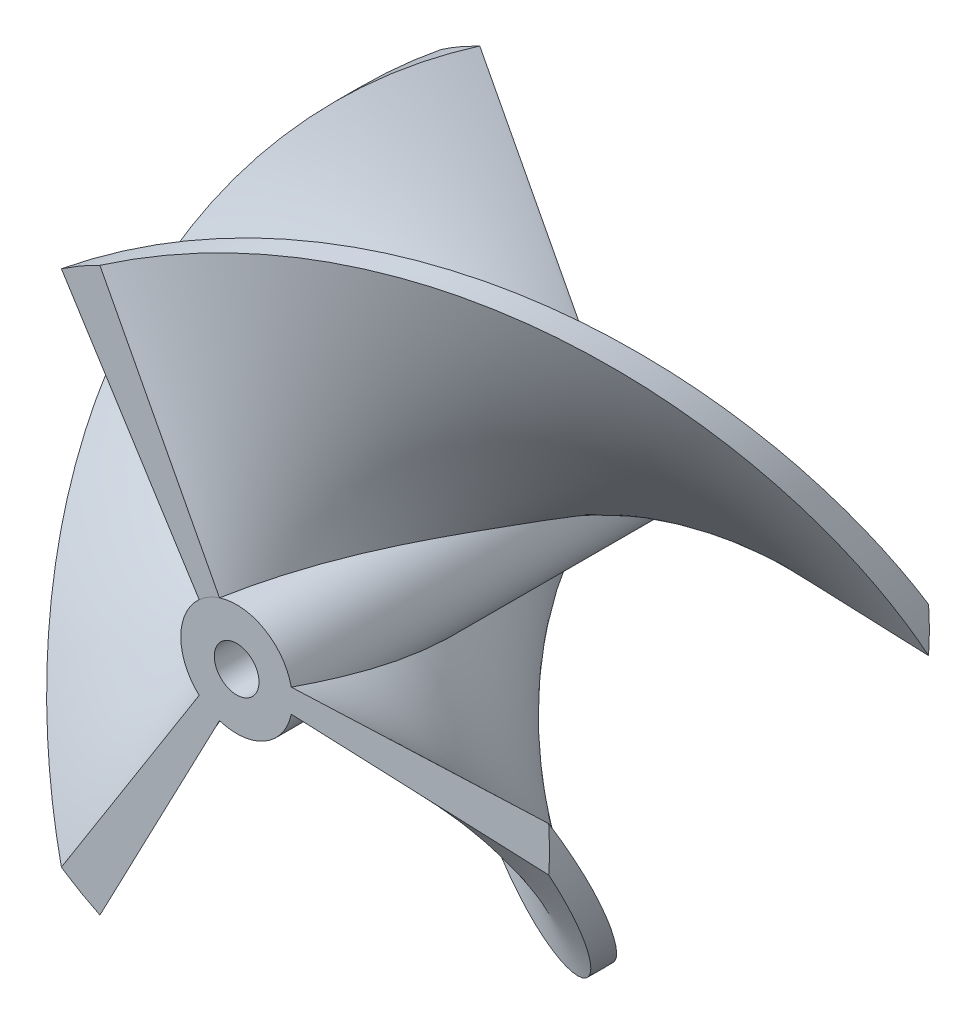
ISO-10303-21;
HEADER;
FILE_DESCRIPTION(('STEP AP214'),'2;1');
FILE_NAME('part.step','',(''),(''),'','','');
FILE_SCHEMA(('AUTOMOTIVE_DESIGN { 1 0 10303 214 1 1 1 1 }'));
ENDSEC;
DATA;
#1=APPLICATION_CONTEXT('core data for automotive mechanical design processes');
#2=APPLICATION_PROTOCOL_DEFINITION('international standard','automotive_design',2000,#1);
#3=PRODUCT_CONTEXT('',#1,'mechanical');
#4=PRODUCT('Part','Part','',(#3));
#5=PRODUCT_RELATED_PRODUCT_CATEGORY('part','',(#4));
#6=PRODUCT_DEFINITION_FORMATION('','',#4);
#7=PRODUCT_DEFINITION_CONTEXT('part definition',#1,'design');
#8=PRODUCT_DEFINITION('design','',#6,#7);
#9=PRODUCT_DEFINITION_SHAPE('','',#8);
#10=(LENGTH_UNIT() NAMED_UNIT(*) SI_UNIT(.MILLI.,.METRE.));
#11=(NAMED_UNIT(*) PLANE_ANGLE_UNIT() SI_UNIT($,.RADIAN.));
#12=(NAMED_UNIT(*) SI_UNIT($,.STERADIAN.) SOLID_ANGLE_UNIT());
#13=UNCERTAINTY_MEASURE_WITH_UNIT(LENGTH_MEASURE(1.E-05),#10,'distance_accuracy_value','');
#14=(GEOMETRIC_REPRESENTATION_CONTEXT(3) GLOBAL_UNCERTAINTY_ASSIGNED_CONTEXT((#13)) GLOBAL_UNIT_ASSIGNED_CONTEXT((#10,
#11,#12)) REPRESENTATION_CONTEXT('',''));
#15=CARTESIAN_POINT('',(0.,0.,0.));
#16=DIRECTION('',(0.,0.,1.));
#17=DIRECTION('',(1.,0.,0.));
#18=AXIS2_PLACEMENT_3D('',#15,#16,#17);
#19=CARTESIAN_POINT('',(0.,0.,24.0710188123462));
#20=DIRECTION('',(0.,0.,-1.));
#21=DIRECTION('',(-1.,0.,0.));
#22=AXIS2_PLACEMENT_3D('',#19,#20,#21);
#23=CYLINDRICAL_SURFACE('',#22,2.49999999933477);
#24=CARTESIAN_POINT('',(0.,0.,16.9999510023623));
#25=DIRECTION('',(0.,0.,-1.));
#26=DIRECTION('',(-1.,0.,0.));
#27=AXIS2_PLACEMENT_3D('',#24,#25,#26);
#28=CIRCLE('',#27,2.49999999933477);
#29=CARTESIAN_POINT('',(-0.767615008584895,2.37923668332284,16.9999510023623));
#30=VERTEX_POINT('',#29);
#31=CARTESIAN_POINT('',(2.44423211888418,0.525099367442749,16.9998860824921));
#32=VERTEX_POINT('',#31);
#33=EDGE_CURVE('E388',#30,#32,#28,.T.);
#34=ORIENTED_EDGE('',*,*,#33,.T.);
#35=CARTESIAN_POINT('',(-0.767463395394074,-2.37928559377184,0.));
#36=CARTESIAN_POINT('',(-0.499382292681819,-2.46575795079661,0.910714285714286));
#37=CARTESIAN_POINT('',(-0.218780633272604,-2.49040860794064,1.82142857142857));
#38=CARTESIAN_POINT('',(0.0618210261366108,-2.51505926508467,2.73214285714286));
#39=CARTESIAN_POINT('',(0.340872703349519,-2.47665213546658,3.64285714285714));
#40=CARTESIAN_POINT('',(0.619924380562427,-2.4382450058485,4.55357142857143));
#41=CARTESIAN_POINT('',(0.883433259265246,-2.33870598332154,5.46428571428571));
#42=CARTESIAN_POINT('',(1.14694213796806,-2.23916696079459,6.375));
#43=CARTESIAN_POINT('',(1.38169478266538,-2.08348734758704,7.28571428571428));
#44=CARTESIAN_POINT('',(1.6164474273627,-1.92780773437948,8.19642857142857));
#45=CARTESIAN_POINT('',(1.81067236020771,-1.72379395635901,9.10714285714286));
#46=CARTESIAN_POINT('',(2.00489729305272,-1.51978017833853,10.0178571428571));
#47=CARTESIAN_POINT('',(2.14885526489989,-1.27766233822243,10.9285714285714));
#48=CARTESIAN_POINT('',(2.29281323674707,-1.03554449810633,11.8392857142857));
#49=CARTESIAN_POINT('',(2.37928559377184,-0.767463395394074,12.75));
#50=CARTESIAN_POINT('',(2.46575795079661,-0.49938229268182,13.6607142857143));
#51=CARTESIAN_POINT('',(2.49040860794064,-0.218780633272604,14.5714285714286));
#52=CARTESIAN_POINT('',(2.51505926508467,0.0618210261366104,15.4821428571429));
#53=CARTESIAN_POINT('',(2.47665213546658,0.340872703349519,16.3928571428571));
#54=CARTESIAN_POINT('',(2.46389457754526,0.433564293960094,16.6953658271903));
#55=CARTESIAN_POINT('',(2.44424423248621,0.525042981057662,16.9995759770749));
#56=(BOUNDED_CURVE() B_SPLINE_CURVE(2,(#35,#36,#37,#38,#39,#40,#41,#42,#43,#44,#45,#46,#47,#48,
#49,#50,#51,#52,#53,#54,#55),.UNSPECIFIED.,.F.,.F.) B_SPLINE_CURVE_WITH_KNOTS((3,2,2,2,2,2,2,2,
2,2,3),(0.,0.0357142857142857,0.0714285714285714,0.107142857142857,0.142857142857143,
0.178571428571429,0.214285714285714,0.25,0.285714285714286,0.321428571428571,0.333341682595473),
.UNSPECIFIED.) CURVE() GEOMETRIC_REPRESENTATION_ITEM() RATIONAL_B_SPLINE_CURVE((1.,
0.993712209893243,1.,0.993712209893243,1.,0.993712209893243,1.,0.993712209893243,1.,
0.993712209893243,1.,0.993712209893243,1.,0.993712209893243,1.,0.993712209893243,1.,
0.993712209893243,1.,0.997902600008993,0.997204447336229)) REPRESENTATION_ITEM(''));
#57=CARTESIAN_POINT('',(-0.767463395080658,-2.37928559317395,0.));
#58=VERTEX_POINT('',#57);
#59=EDGE_CURVE('E78',#58,#32,#56,.T.);
#60=ORIENTED_EDGE('',*,*,#59,.F.);
#61=CARTESIAN_POINT('',(0.,0.,0.));
#62=DIRECTION('',(0.,0.,1.));
#63=DIRECTION('',(1.,0.,0.));
#64=AXIS2_PLACEMENT_3D('',#61,#62,#63);
#65=CIRCLE('',#64,2.49999999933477);
#66=CARTESIAN_POINT('',(2.44425346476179,-0.525000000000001,0.));
#67=VERTEX_POINT('',#66);
#68=EDGE_CURVE('E402',#58,#67,#65,.T.);
#69=ORIENTED_EDGE('',*,*,#68,.T.);
#70=CARTESIAN_POINT('',(2.44425346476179,-0.525000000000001,0.));
#71=CARTESIAN_POINT('',(2.50340675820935,-0.249598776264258,0.910714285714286));
#72=CARTESIAN_POINT('',(2.49979441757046,0.0320604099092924,1.82142857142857));
#73=CARTESIAN_POINT('',(2.49618207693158,0.313719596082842,2.73214285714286));
#74=CARTESIAN_POINT('',(2.42998524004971,0.58751317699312,3.64285714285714));
#75=CARTESIAN_POINT('',(2.36378840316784,0.861306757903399,4.55357142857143));
#76=CARTESIAN_POINT('',(2.23832645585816,1.11350558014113,5.46428571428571));
#77=CARTESIAN_POINT('',(2.11286450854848,1.36570440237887,6.375));
#78=CARTESIAN_POINT('',(1.93442863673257,1.58366216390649,7.28571428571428));
#79=CARTESIAN_POINT('',(1.75599276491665,1.80161992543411,8.19642857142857));
#80=CARTESIAN_POINT('',(1.53353048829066,1.97440731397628,9.10714285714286));
#81=CARTESIAN_POINT('',(1.31106821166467,2.14719470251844,10.0178571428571));
#82=CARTESIAN_POINT('',(1.05573471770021,2.26614743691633,10.9285714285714));
#83=CARTESIAN_POINT('',(0.800401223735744,2.38510017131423,11.8392857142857));
#84=CARTESIAN_POINT('',(0.525000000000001,2.44425346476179,12.75));
#85=CARTESIAN_POINT('',(0.249598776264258,2.50340675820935,13.6607142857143));
#86=CARTESIAN_POINT('',(-0.0320604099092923,2.49979441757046,14.5714285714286));
#87=CARTESIAN_POINT('',(-0.313719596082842,2.49618207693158,15.4821428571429));
#88=CARTESIAN_POINT('',(-0.58751317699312,2.42998524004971,16.3928571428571));
#89=CARTESIAN_POINT('',(-0.678514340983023,2.40798330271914,16.695552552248));
#90=CARTESIAN_POINT('',(-0.767615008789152,2.37923668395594,16.9999510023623));
#91=(BOUNDED_CURVE() B_SPLINE_CURVE(2,(#70,#71,#72,#73,#74,#75,#76,#77,#78,#79,#80,#81,#82,#83,
#84,#85,#86,#87,#88,#89,#90),.UNSPECIFIED.,.F.,.F.) B_SPLINE_CURVE_WITH_KNOTS((3,2,2,2,2,2,2,2,
2,2,3),(0.,0.0357142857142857,0.0714285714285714,0.107142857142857,0.142857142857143,
0.178571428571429,0.214285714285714,0.25,0.285714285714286,0.321428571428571,0.333349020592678),
.UNSPECIFIED.) CURVE() GEOMETRIC_REPRESENTATION_ITEM() RATIONAL_B_SPLINE_CURVE((1.,
0.993712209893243,1.,0.993712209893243,1.,0.993712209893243,1.,0.993712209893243,1.,
0.993712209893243,1.,0.993712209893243,1.,0.993712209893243,1.,0.993712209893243,1.,
0.993712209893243,1.,0.997901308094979,0.997203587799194)) REPRESENTATION_ITEM(''));
#92=EDGE_CURVE('E586',#67,#30,#91,.T.);
#93=ORIENTED_EDGE('',*,*,#92,.T.);
#94=EDGE_LOOP('',(#34,#60,#69,#93));
#95=FACE_BOUND('',#94,.T.);
#96=ADVANCED_FACE('F59',(#95),#23,.T.);
#97=CARTESIAN_POINT('',(-1.67679006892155,1.85428559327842,0.));
#98=VERTEX_POINT('',#97);
#99=CARTESIAN_POINT('',(-1.67679006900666,-1.85428559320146,0.));
#100=VERTEX_POINT('',#99);
#101=EDGE_CURVE('E87',#98,#100,#65,.T.);
#102=ORIENTED_EDGE('',*,*,#101,.T.);
#103=CARTESIAN_POINT('',(-1.67679006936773,-1.85428559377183,0.));
#104=CARTESIAN_POINT('',(-1.46786226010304,-2.04321446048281,0.910714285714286));
#105=CARTESIAN_POINT('',(-1.22213207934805,-2.18091567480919,1.82142857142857));
#106=CARTESIAN_POINT('',(-0.976401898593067,-2.31861688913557,2.73214285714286));
#107=CARTESIAN_POINT('',(-0.706191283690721,-2.39818553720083,3.64285714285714));
#108=CARTESIAN_POINT('',(-0.435980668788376,-2.4777541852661,4.55357142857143));
#109=CARTESIAN_POINT('',(-0.154839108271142,-2.49520036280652,5.46428571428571));
#110=CARTESIAN_POINT('',(0.126302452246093,-2.51264654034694,6.375));
#111=CARTESIAN_POINT('',(0.404277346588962,-2.46709542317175,7.28571428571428));
#112=CARTESIAN_POINT('',(0.682252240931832,-2.42154430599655,8.19642857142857));
#113=CARTESIAN_POINT('',(0.943121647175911,-2.31528001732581,9.10714285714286));
#114=CARTESIAN_POINT('',(1.20399105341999,-2.20901572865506,10.0178571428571));
#115=CARTESIAN_POINT('',(1.43467389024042,-2.04736680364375,10.9285714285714));
#116=CARTESIAN_POINT('',(1.66535672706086,-1.88571787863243,11.8392857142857));
#117=CARTESIAN_POINT('',(1.85428559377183,-1.67679006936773,12.75));
#118=CARTESIAN_POINT('',(2.04321446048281,-1.46786226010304,13.6607142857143));
#119=CARTESIAN_POINT('',(2.18091567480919,-1.22213207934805,14.5714285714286));
#120=CARTESIAN_POINT('',(2.31861688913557,-0.976401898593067,15.4821428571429));
#121=CARTESIAN_POINT('',(2.39818553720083,-0.706191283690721,16.3928571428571));
#122=CARTESIAN_POINT('',(2.42463188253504,-0.616380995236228,16.695552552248));
#123=CARTESIAN_POINT('',(2.44428691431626,-0.524844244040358,16.9999510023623));
#124=(BOUNDED_CURVE() B_SPLINE_CURVE(2,(#103,#104,#105,#106,#107,#108,#109,#110,#111,#112,#113,
#114,#115,#116,#117,#118,#119,#120,#121,#122,#123),.UNSPECIFIED.,.F.,
.F.) B_SPLINE_CURVE_WITH_KNOTS((3,2,2,2,2,2,2,2,2,2,3),(0.,0.0357142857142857,
0.0714285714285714,0.107142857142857,0.142857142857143,0.178571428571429,0.214285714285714,0.25,
0.285714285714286,0.321428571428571,0.333349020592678),
.UNSPECIFIED.) CURVE() GEOMETRIC_REPRESENTATION_ITEM() RATIONAL_B_SPLINE_CURVE((1.,
0.993712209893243,1.,0.993712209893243,1.,0.993712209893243,1.,0.993712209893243,1.,
0.993712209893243,1.,0.993712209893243,1.,0.993712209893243,1.,0.993712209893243,1.,
0.993712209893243,1.,0.997901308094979,0.997203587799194)) REPRESENTATION_ITEM(''));
#125=CARTESIAN_POINT('',(2.44428691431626,-0.524844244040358,16.9999510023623));
#126=VERTEX_POINT('',#125);
#127=EDGE_CURVE('E161',#100,#126,#124,.T.);
#128=ORIENTED_EDGE('',*,*,#127,.T.);
#129=CARTESIAN_POINT('',(-0.767366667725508,-2.37931679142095,16.9998860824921));
#130=VERTEX_POINT('',#129);
#131=EDGE_CURVE('E396',#126,#130,#28,.T.);
#132=ORIENTED_EDGE('',*,*,#131,.T.);
#133=CARTESIAN_POINT('',(-1.67679006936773,1.85428559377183,0.));
#134=CARTESIAN_POINT('',(-1.88571787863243,1.66535672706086,0.910714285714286));
#135=CARTESIAN_POINT('',(-2.04736680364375,1.43467389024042,1.82142857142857));
#136=CARTESIAN_POINT('',(-2.20901572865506,1.20399105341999,2.73214285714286));
#137=CARTESIAN_POINT('',(-2.31528001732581,0.943121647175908,3.64285714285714));
#138=CARTESIAN_POINT('',(-2.42154430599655,0.68225224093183,4.55357142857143));
#139=CARTESIAN_POINT('',(-2.46709542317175,0.40427734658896,5.46428571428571));
#140=CARTESIAN_POINT('',(-2.51264654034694,0.126302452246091,6.375));
#141=CARTESIAN_POINT('',(-2.49520036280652,-0.154839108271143,7.28571428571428));
#142=CARTESIAN_POINT('',(-2.4777541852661,-0.435980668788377,8.19642857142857));
#143=CARTESIAN_POINT('',(-2.39818553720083,-0.706191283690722,9.10714285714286));
#144=CARTESIAN_POINT('',(-2.31861688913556,-0.976401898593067,10.0178571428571));
#145=CARTESIAN_POINT('',(-2.18091567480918,-1.22213207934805,10.9285714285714));
#146=CARTESIAN_POINT('',(-2.0432144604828,-1.46786226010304,11.8392857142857));
#147=CARTESIAN_POINT('',(-1.85428559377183,-1.67679006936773,12.75));
#148=CARTESIAN_POINT('',(-1.66535672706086,-1.88571787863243,13.6607142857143));
#149=CARTESIAN_POINT('',(-1.43467389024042,-2.04736680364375,14.5714285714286));
#150=CARTESIAN_POINT('',(-1.20399105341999,-2.20901572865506,15.4821428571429));
#151=CARTESIAN_POINT('',(-0.943121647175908,-2.31528001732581,16.3928571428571));
#152=CARTESIAN_POINT('',(-0.8564695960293,-2.35057744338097,16.6953658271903));
#153=CARTESIAN_POINT('',(-0.767421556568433,-2.37929908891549,16.9995759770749));
#154=(BOUNDED_CURVE() B_SPLINE_CURVE(2,(#133,#134,#135,#136,#137,#138,#139,#140,#141,#142,#143,
#144,#145,#146,#147,#148,#149,#150,#151,#152,#153),.UNSPECIFIED.,.F.,
.F.) B_SPLINE_CURVE_WITH_KNOTS((3,2,2,2,2,2,2,2,2,2,3),(0.,0.0357142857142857,
0.0714285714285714,0.107142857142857,0.142857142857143,0.178571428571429,0.214285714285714,0.25,
0.285714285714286,0.321428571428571,0.333341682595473),
.UNSPECIFIED.) CURVE() GEOMETRIC_REPRESENTATION_ITEM() RATIONAL_B_SPLINE_CURVE((1.,
0.993712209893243,1.,0.993712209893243,1.,0.993712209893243,1.,0.993712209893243,1.,
0.993712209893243,1.,0.993712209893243,1.,0.993712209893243,1.,0.993712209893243,1.,
0.993712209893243,1.,0.997902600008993,0.997204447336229)) REPRESENTATION_ITEM(''));
#155=EDGE_CURVE('E290',#98,#130,#154,.T.);
#156=ORIENTED_EDGE('',*,*,#155,.F.);
#157=EDGE_LOOP('',(#102,#128,#132,#156));
#158=FACE_BOUND('',#157,.T.);
#159=ADVANCED_FACE('F552',(#158),#23,.T.);
#160=CARTESIAN_POINT('',(14.,0.,0.));
#161=DIRECTION('',(0.,0.,-1.));
#162=DIRECTION('',(-1.,0.,0.));
#163=AXIS2_PLACEMENT_3D('',#160,#161,#162);
#164=PLANE('',#163);
#165=CARTESIAN_POINT('',(13.9645972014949,-0.995000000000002,0.));
#166=CARTESIAN_POINT('',(14.0118208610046,-0.332226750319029,0.));
#167=CARTESIAN_POINT('',(14.0118208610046,0.332226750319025,0.));
#168=CARTESIAN_POINT('',(13.9645972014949,0.994999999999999,0.));
#169=(BOUNDED_CURVE() B_SPLINE_CURVE(3,(#165,#166,#167,#168),.UNSPECIFIED.,.F.,
.F.) B_SPLINE_CURVE_WITH_KNOTS((4,4),(0.,1.),
.UNSPECIFIED.) CURVE() GEOMETRIC_REPRESENTATION_ITEM() RATIONAL_B_SPLINE_CURVE((1.,
0.99831415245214,0.99831415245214,1.)) REPRESENTATION_ITEM(''));
#170=CARTESIAN_POINT('',(13.9645972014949,-0.995,0.));
#171=VERTEX_POINT('',#170);
#172=CARTESIAN_POINT('',(13.9645972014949,0.994999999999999,0.));
#173=VERTEX_POINT('',#172);
#174=EDGE_CURVE('E71',#171,#173,#169,.T.);
#175=ORIENTED_EDGE('',*,*,#174,.F.);
#176=CARTESIAN_POINT('',(2.44425346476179,-0.525,0.));
#177=CARTESIAN_POINT('',(13.9645972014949,-0.995,0.));
#178=(BOUNDED_CURVE() B_SPLINE_CURVE(1,(#176,#177),.UNSPECIFIED.,.F.,
.F.) B_SPLINE_CURVE_WITH_KNOTS((2,2),(0.,1.),
.UNSPECIFIED.) CURVE() GEOMETRIC_REPRESENTATION_ITEM() RATIONAL_B_SPLINE_CURVE((1.,1.)) REPRESENTATION_ITEM(''));
#179=EDGE_CURVE('E585',#67,#171,#178,.T.);
#180=ORIENTED_EDGE('',*,*,#179,.F.);
#181=ORIENTED_EDGE('',*,*,#68,.F.);
#182=CARTESIAN_POINT('',(-6.12060332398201,-12.5911959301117,0.));
#183=CARTESIAN_POINT('',(-0.767463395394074,-2.37928559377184,0.));
#184=(BOUNDED_CURVE() B_SPLINE_CURVE(1,(#182,#183),.UNSPECIFIED.,.F.,
.F.) B_SPLINE_CURVE_WITH_KNOTS((2,2),(0.,1.),
.UNSPECIFIED.) CURVE() GEOMETRIC_REPRESENTATION_ITEM() RATIONAL_B_SPLINE_CURVE((1.,1.)) REPRESENTATION_ITEM(''));
#185=CARTESIAN_POINT('',(-6.12060332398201,-12.5911959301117,0.));
#186=VERTEX_POINT('',#185);
#187=EDGE_CURVE('E181',#186,#58,#184,.T.);
#188=ORIENTED_EDGE('',*,*,#187,.F.);
#189=CARTESIAN_POINT('',(-7.84399387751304,-11.5961959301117,0.));
#190=CARTESIAN_POINT('',(-7.29362723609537,-11.9684794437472,0.));
#191=CARTESIAN_POINT('',(-6.71819362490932,-12.3007061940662,0.));
#192=CARTESIAN_POINT('',(-6.12060332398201,-12.5911959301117,0.));
#193=(BOUNDED_CURVE() B_SPLINE_CURVE(3,(#189,#190,#191,#192),.UNSPECIFIED.,.F.,
.F.) B_SPLINE_CURVE_WITH_KNOTS((4,4),(0.,1.),
.UNSPECIFIED.) CURVE() GEOMETRIC_REPRESENTATION_ITEM() RATIONAL_B_SPLINE_CURVE((1.,
0.99831415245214,0.99831415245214,1.)) REPRESENTATION_ITEM(''));
#194=CARTESIAN_POINT('',(-7.84399387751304,-11.5961959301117,0.));
#195=VERTEX_POINT('',#194);
#196=EDGE_CURVE('E169',#195,#186,#193,.T.);
#197=ORIENTED_EDGE('',*,*,#196,.F.);
#198=CARTESIAN_POINT('',(-1.67679006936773,-1.85428559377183,0.));
#199=CARTESIAN_POINT('',(-7.84399387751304,-11.5961959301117,0.));
#200=(BOUNDED_CURVE() B_SPLINE_CURVE(1,(#198,#199),.UNSPECIFIED.,.F.,
.F.) B_SPLINE_CURVE_WITH_KNOTS((2,2),(0.,1.),
.UNSPECIFIED.) CURVE() GEOMETRIC_REPRESENTATION_ITEM() RATIONAL_B_SPLINE_CURVE((1.,1.)) REPRESENTATION_ITEM(''));
#201=EDGE_CURVE('E154',#100,#195,#200,.T.);
#202=ORIENTED_EDGE('',*,*,#201,.F.);
#203=ORIENTED_EDGE('',*,*,#101,.F.);
#204=CARTESIAN_POINT('',(-7.84399387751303,11.5961959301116,0.));
#205=CARTESIAN_POINT('',(-1.67679006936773,1.85428559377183,0.));
#206=(BOUNDED_CURVE() B_SPLINE_CURVE(1,(#204,#205),.UNSPECIFIED.,.F.,
.F.) B_SPLINE_CURVE_WITH_KNOTS((2,2),(0.,1.),
.UNSPECIFIED.) CURVE() GEOMETRIC_REPRESENTATION_ITEM() RATIONAL_B_SPLINE_CURVE((1.,1.)) REPRESENTATION_ITEM(''));
#207=CARTESIAN_POINT('',(-7.84399387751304,11.5961959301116,0.));
#208=VERTEX_POINT('',#207);
#209=EDGE_CURVE('E363',#208,#98,#206,.T.);
#210=ORIENTED_EDGE('',*,*,#209,.F.);
#211=CARTESIAN_POINT('',(-6.12060332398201,12.5911959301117,0.));
#212=CARTESIAN_POINT('',(-6.71819362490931,12.3007061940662,0.));
#213=CARTESIAN_POINT('',(-7.29362723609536,11.9684794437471,0.));
#214=CARTESIAN_POINT('',(-7.84399387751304,11.5961959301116,0.));
#215=(BOUNDED_CURVE() B_SPLINE_CURVE(3,(#211,#212,#213,#214),.UNSPECIFIED.,.F.,
.F.) B_SPLINE_CURVE_WITH_KNOTS((4,4),(0.,1.),
.UNSPECIFIED.) CURVE() GEOMETRIC_REPRESENTATION_ITEM() RATIONAL_B_SPLINE_CURVE((1.,
0.99831415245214,0.99831415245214,1.)) REPRESENTATION_ITEM(''));
#216=CARTESIAN_POINT('',(-6.12060332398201,12.5911959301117,0.));
#217=VERTEX_POINT('',#216);
#218=EDGE_CURVE('E340',#217,#208,#215,.T.);
#219=ORIENTED_EDGE('',*,*,#218,.F.);
#220=CARTESIAN_POINT('',(-0.767463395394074,2.37928559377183,0.));
#221=CARTESIAN_POINT('',(-6.12060332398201,12.5911959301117,0.));
#222=(BOUNDED_CURVE() B_SPLINE_CURVE(1,(#220,#221),.UNSPECIFIED.,.F.,
.F.) B_SPLINE_CURVE_WITH_KNOTS((2,2),(0.,1.),
.UNSPECIFIED.) CURVE() GEOMETRIC_REPRESENTATION_ITEM() RATIONAL_B_SPLINE_CURVE((1.,1.)) REPRESENTATION_ITEM(''));
#223=CARTESIAN_POINT('',(-0.767463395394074,2.37928559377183,0.));
#224=VERTEX_POINT('',#223);
#225=EDGE_CURVE('E321',#224,#217,#222,.T.);
#226=ORIENTED_EDGE('',*,*,#225,.F.);
#227=CARTESIAN_POINT('',(2.44425346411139,0.524999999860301,0.));
#228=VERTEX_POINT('',#227);
#229=EDGE_CURVE('E385',#228,#224,#65,.T.);
#230=ORIENTED_EDGE('',*,*,#229,.F.);
#231=CARTESIAN_POINT('',(13.9645972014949,0.995,0.));
#232=CARTESIAN_POINT('',(2.44425346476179,0.525,0.));
#233=(BOUNDED_CURVE() B_SPLINE_CURVE(1,(#231,#232),.UNSPECIFIED.,.F.,
.F.) B_SPLINE_CURVE_WITH_KNOTS((2,2),(0.,1.),
.UNSPECIFIED.) CURVE() GEOMETRIC_REPRESENTATION_ITEM() RATIONAL_B_SPLINE_CURVE((1.,1.)) REPRESENTATION_ITEM(''));
#234=EDGE_CURVE('E384',#173,#228,#233,.T.);
#235=ORIENTED_EDGE('',*,*,#234,.F.);
#236=EDGE_LOOP('',(#175,#180,#181,#188,#197,#202,#203,#210,#219,#226,#230,#235));
#237=FACE_BOUND('',#236,.T.);
#238=CARTESIAN_POINT('',(0.,0.,0.));
#239=DIRECTION('',(0.,0.,1.));
#240=DIRECTION('',(1.,0.,0.));
#241=AXIS2_PLACEMENT_3D('',#238,#239,#240);
#242=CIRCLE('',#241,1.);
#243=CARTESIAN_POINT('',(1.,0.,0.));
#244=VERTEX_POINT('',#243);
#245=EDGE_CURVE('E373',#244,#244,#242,.T.);
#246=ORIENTED_EDGE('',*,*,#245,.T.);
#247=EDGE_LOOP('',(#246));
#248=FACE_BOUND('',#247,.T.);
#249=ADVANCED_FACE('F178',(#237,#248),#164,.T.);
#250=CARTESIAN_POINT('',(-7.42703573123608,11.86756673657,16.9995759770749));
#251=DIRECTION('',(0.,0.,1.));
#252=DIRECTION('',(1.,0.,0.));
#253=AXIS2_PLACEMENT_3D('',#250,#251,#252);
#254=PLANE('',#253);
#255=CARTESIAN_POINT('',(-7.84419779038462,11.5960579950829,16.9995759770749));
#256=CARTESIAN_POINT('',(-7.29383769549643,11.9683511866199,16.9995759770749));
#257=CARTESIAN_POINT('',(-6.7184099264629,12.3005880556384,16.9995759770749));
#258=CARTESIAN_POINT('',(-6.12082473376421,12.5910883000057,16.9995759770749));
#259=(BOUNDED_CURVE() B_SPLINE_CURVE(3,(#255,#256,#257,#258),.UNSPECIFIED.,.F.,
.F.) B_SPLINE_CURVE_WITH_KNOTS((4,4),(0.,1.),
.UNSPECIFIED.) CURVE() GEOMETRIC_REPRESENTATION_ITEM() RATIONAL_B_SPLINE_CURVE((0.997204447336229,
0.995523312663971,0.995523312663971,0.997204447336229)) REPRESENTATION_ITEM(''));
#260=CARTESIAN_POINT('',(-7.84419779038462,11.5960579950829,16.9995759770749));
#261=VERTEX_POINT('',#260);
#262=CARTESIAN_POINT('',(-6.12111519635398,12.5909470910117,16.9997634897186));
#263=VERTEX_POINT('',#262);
#264=EDGE_CURVE('E12',#261,#263,#259,.T.);
#265=ORIENTED_EDGE('',*,*,#264,.F.);
#266=CARTESIAN_POINT('',(-1.67682267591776,1.85425610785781,16.9995759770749));
#267=CARTESIAN_POINT('',(-7.84419779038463,11.5960579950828,16.9995759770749));
#268=(BOUNDED_CURVE() B_SPLINE_CURVE(1,(#266,#267),.UNSPECIFIED.,.F.,
.F.) B_SPLINE_CURVE_WITH_KNOTS((2,2),(0.,1.),
.UNSPECIFIED.) CURVE() GEOMETRIC_REPRESENTATION_ITEM() RATIONAL_B_SPLINE_CURVE((0.997204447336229,0.997204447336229)) REPRESENTATION_ITEM(''));
#269=CARTESIAN_POINT('',(-1.67686545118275,1.8542174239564,16.999886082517));
#270=VERTEX_POINT('',#269);
#271=EDGE_CURVE('E589',#270,#261,#268,.T.);
#272=ORIENTED_EDGE('',*,*,#271,.F.);
#273=CARTESIAN_POINT('',(-1.67690822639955,1.85417874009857,16.9995759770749));
#274=CARTESIAN_POINT('',(-1.27859034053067,2.21425756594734,16.9995759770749));
#275=CARTESIAN_POINT('',(-0.767615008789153,2.37923668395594,16.9995759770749));
#276=B_SPLINE_CURVE_WITH_KNOTS('',2,(#273,#274,#275),.UNSPECIFIED.,.F.,.F.,(3,3),(0.,1.),.UNSPECIFIED.);
#277=EDGE_CURVE('E579',#270,#30,#276,.T.);
#278=ORIENTED_EDGE('',*,*,#277,.T.);
#279=CARTESIAN_POINT('',(-6.12140565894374,12.5908058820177,16.9999510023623));
#280=CARTESIAN_POINT('',(-0.767615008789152,2.37923668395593,16.9999510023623));
#281=(BOUNDED_CURVE() B_SPLINE_CURVE(1,(#279,#280),.UNSPECIFIED.,.F.,
.F.) B_SPLINE_CURVE_WITH_KNOTS((2,2),(0.,1.),
.UNSPECIFIED.) CURVE() GEOMETRIC_REPRESENTATION_ITEM() RATIONAL_B_SPLINE_CURVE((0.997203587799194,0.997203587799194)) REPRESENTATION_ITEM(''));
#282=EDGE_CURVE('E710',#263,#30,#281,.T.);
#283=ORIENTED_EDGE('',*,*,#282,.F.);
#284=EDGE_LOOP('',(#265,#272,#278,#283));
#285=FACE_BOUND('',#284,.T.);
#286=ADVANCED_FACE('F61',(#285),#254,.T.);
#287=CARTESIAN_POINT('',(13.9645972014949,-0.995000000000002,0.));
#288=CARTESIAN_POINT('',(14.0767067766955,0.578432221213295,0.910714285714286));
#289=CARTESIAN_POINT('',(13.8358839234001,2.13736193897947,1.82142857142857));
#290=CARTESIAN_POINT('',(13.5950610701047,3.69629165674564,2.73214285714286));
#291=CARTESIAN_POINT('',(13.0133816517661,5.1625476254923,3.64285714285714));
#292=CARTESIAN_POINT('',(12.4317022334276,6.62880359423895,4.55357142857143));
#293=CARTESIAN_POINT('',(11.5383340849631,7.92886161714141,5.46428571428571));
#294=CARTESIAN_POINT('',(10.6449659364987,9.22891964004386,6.375));
#295=CARTESIAN_POINT('',(9.48470626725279,10.2975893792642,7.28571428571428));
#296=CARTESIAN_POINT('',(8.32444659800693,11.3662591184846,8.19642857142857));
#297=CARTESIAN_POINT('',(6.95547567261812,12.1499530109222,9.10714285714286));
#298=CARTESIAN_POINT('',(5.58650474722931,12.9336469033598,10.0178571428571));
#299=CARTESIAN_POINT('',(4.0774684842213,13.3930672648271,10.9285714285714));
#300=CARTESIAN_POINT('',(2.5684322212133,13.8524876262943,11.8392857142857));
#301=CARTESIAN_POINT('',(0.995000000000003,13.9645972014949,12.75));
#302=CARTESIAN_POINT('',(-0.578432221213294,14.0767067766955,13.6607142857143));
#303=CARTESIAN_POINT('',(-2.13736193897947,13.8358839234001,14.5714285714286));
#304=CARTESIAN_POINT('',(-3.69629165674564,13.5950610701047,15.4821428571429));
#305=CARTESIAN_POINT('',(-5.1625476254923,13.0133816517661,16.3928571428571));
#306=CARTESIAN_POINT('',(-5.64958858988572,12.8201672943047,16.6953658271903));
#307=CARTESIAN_POINT('',(-6.12082473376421,12.5910883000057,16.9995759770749));
#308=CARTESIAN_POINT('',(-6.25277399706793,12.526944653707,17.0847568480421));
#309=CARTESIAN_POINT('',(-6.38472326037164,12.4628010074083,17.1699377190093));
#310=CARTESIAN_POINT('',(14.0118208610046,-0.332226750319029,0.));
#311=CARTESIAN_POINT('',(14.0492538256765,1.24652629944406,0.910714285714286));
#312=CARTESIAN_POINT('',(13.7344426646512,2.79402633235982,1.82142857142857));
#313=CARTESIAN_POINT('',(13.4196315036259,4.34152636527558,2.73214285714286));
#314=CARTESIAN_POINT('',(12.7683621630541,5.78017526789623,3.64285714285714));
#315=CARTESIAN_POINT('',(12.1170928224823,7.21882417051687,4.55357142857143));
#316=CARTESIAN_POINT('',(11.1620226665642,8.47648207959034,5.46428571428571));
#317=CARTESIAN_POINT('',(10.2069525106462,9.73413998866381,6.375));
#318=CARTESIAN_POINT('',(8.99597274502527,10.7477426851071,7.28571428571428));
#319=CARTESIAN_POINT('',(7.78499297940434,11.7613453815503,8.19642857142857));
#320=CARTESIAN_POINT('',(6.3788271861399,12.4800665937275,9.10714285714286));
#321=CARTESIAN_POINT('',(4.97266139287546,13.1987878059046,10.0178571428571));
#322=CARTESIAN_POINT('',(3.44182059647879,13.5865878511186,10.9285714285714));
#323=CARTESIAN_POINT('',(1.91097980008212,13.9743878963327,11.8392857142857));
#324=CARTESIAN_POINT('',(0.33222675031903,14.0118208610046,12.75));
#325=CARTESIAN_POINT('',(-1.24652629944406,14.0492538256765,13.6607142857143));
#326=CARTESIAN_POINT('',(-2.79402633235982,13.7344426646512,14.5714285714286));
#327=CARTESIAN_POINT('',(-4.34152636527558,13.4196315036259,15.4821428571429));
#328=CARTESIAN_POINT('',(-5.78017526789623,12.7683621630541,16.3928571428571));
#329=CARTESIAN_POINT('',(-6.25804609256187,12.5520323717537,16.6953658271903));
#330=CARTESIAN_POINT('',(-6.7184099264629,12.3005880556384,16.9995759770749));
#331=CARTESIAN_POINT('',(-6.84731487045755,12.2301819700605,17.0847568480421));
#332=CARTESIAN_POINT('',(-6.9762198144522,12.1597758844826,17.1699377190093));
#333=CARTESIAN_POINT('',(14.0118208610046,0.332226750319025,0.));
#334=CARTESIAN_POINT('',(13.9743878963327,1.91097980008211,0.910714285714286));
#335=CARTESIAN_POINT('',(13.5865878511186,3.44182059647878,1.82142857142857));
#336=CARTESIAN_POINT('',(13.1987878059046,4.97266139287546,2.73214285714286));
#337=CARTESIAN_POINT('',(12.4800665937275,6.37882718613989,3.64285714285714));
#338=CARTESIAN_POINT('',(11.7613453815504,7.78499297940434,4.55357142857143));
#339=CARTESIAN_POINT('',(10.7477426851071,8.99597274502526,5.46428571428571));
#340=CARTESIAN_POINT('',(9.73413998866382,10.2069525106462,6.375));
#341=CARTESIAN_POINT('',(8.47648207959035,11.1620226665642,7.28571428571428));
#342=CARTESIAN_POINT('',(7.21882417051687,12.1170928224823,8.19642857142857));
#343=CARTESIAN_POINT('',(5.78017526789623,12.7683621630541,9.10714285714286));
#344=CARTESIAN_POINT('',(4.34152636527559,13.4196315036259,10.0178571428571));
#345=CARTESIAN_POINT('',(2.79402633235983,13.7344426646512,10.9285714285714));
#346=CARTESIAN_POINT('',(1.24652629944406,14.0492538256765,11.8392857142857));
#347=CARTESIAN_POINT('',(-0.332226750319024,14.0118208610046,12.75));
#348=CARTESIAN_POINT('',(-1.91097980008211,13.9743878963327,13.6607142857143));
#349=CARTESIAN_POINT('',(-3.44182059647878,13.5865878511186,14.5714285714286));
#350=CARTESIAN_POINT('',(-4.97266139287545,13.1987878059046,15.4821428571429));
#351=CARTESIAN_POINT('',(-6.37882718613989,12.4800665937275,16.3928571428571));
#352=CARTESIAN_POINT('',(-6.84590821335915,12.241331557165,16.6953658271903));
#353=CARTESIAN_POINT('',(-7.29383769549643,11.9683511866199,16.9995759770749));
#354=CARTESIAN_POINT('',(-7.41926093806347,11.891914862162,17.0847568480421));
#355=CARTESIAN_POINT('',(-7.54468418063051,11.815478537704,17.1699377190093));
#356=CARTESIAN_POINT('',(13.9645972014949,0.994999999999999,0.));
#357=CARTESIAN_POINT('',(13.8524876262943,2.5684322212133,0.910714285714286));
#358=CARTESIAN_POINT('',(13.3930672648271,4.0774684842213,1.82142857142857));
#359=CARTESIAN_POINT('',(12.9336469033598,5.5865047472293,2.73214285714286));
#360=CARTESIAN_POINT('',(12.1499530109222,6.95547567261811,3.64285714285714));
#361=CARTESIAN_POINT('',(11.3662591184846,8.32444659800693,4.55357142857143));
#362=CARTESIAN_POINT('',(10.2975893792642,9.48470626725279,5.46428571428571));
#363=CARTESIAN_POINT('',(9.22891964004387,10.6449659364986,6.375));
#364=CARTESIAN_POINT('',(7.92886161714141,11.5383340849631,7.28571428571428));
#365=CARTESIAN_POINT('',(6.62880359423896,12.4317022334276,8.19642857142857));
#366=CARTESIAN_POINT('',(5.1625476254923,13.0133816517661,9.10714285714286));
#367=CARTESIAN_POINT('',(3.69629165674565,13.5950610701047,10.0178571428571));
#368=CARTESIAN_POINT('',(2.13736193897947,13.8358839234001,10.9285714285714));
#369=CARTESIAN_POINT('',(0.578432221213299,14.0767067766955,11.8392857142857));
#370=CARTESIAN_POINT('',(-0.994999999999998,13.9645972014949,12.75));
#371=CARTESIAN_POINT('',(-2.56843222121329,13.8524876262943,13.6607142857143));
#372=CARTESIAN_POINT('',(-4.0774684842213,13.3930672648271,14.5714285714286));
#373=CARTESIAN_POINT('',(-5.5865047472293,12.9336469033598,15.4821428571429));
#374=CARTESIAN_POINT('',(-6.95547567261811,12.1499530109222,16.3928571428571));
#375=CARTESIAN_POINT('',(-7.41020181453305,11.8896362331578,16.6953658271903));
#376=CARTESIAN_POINT('',(-7.84419779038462,11.5960579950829,16.9995759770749));
#377=CARTESIAN_POINT('',(-7.96571955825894,11.5138541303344,17.0847568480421));
#378=CARTESIAN_POINT('',(-8.08724132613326,11.4316502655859,17.1699377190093));
#379=(BOUNDED_SURFACE() B_SPLINE_SURFACE(3,2,((#287,#288,#289,#290,#291,#292,#293,#294,#295,
#296,#297,#298,#299,#300,#301,#302,#303,#304,#305,#306,#307,#308,#309),(#310,#311,#312,#313,
#314,#315,#316,#317,#318,#319,#320,#321,#322,#323,#324,#325,#326,#327,#328,#329,#330,#331,#332),
(#333,#334,#335,#336,#337,#338,#339,#340,#341,#342,#343,#344,#345,#346,#347,#348,#349,#350,#351,
#352,#353,#354,#355),(#356,#357,#358,#359,#360,#361,#362,#363,#364,#365,#366,#367,#368,#369,
#370,#371,#372,#373,#374,#375,#376,#377,#378)),.UNSPECIFIED.,.F.,.F.,
.F.) B_SPLINE_SURFACE_WITH_KNOTS((4,4),(3,2,2,2,2,2,2,2,2,2,2,3),(0.,1.),(0.,0.0357142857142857,
0.0714285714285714,0.107142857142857,0.142857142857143,0.178571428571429,0.214285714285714,0.25,
0.285714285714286,0.321428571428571,0.333341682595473,0.336675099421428),
.UNSPECIFIED.) GEOMETRIC_REPRESENTATION_ITEM() RATIONAL_B_SPLINE_SURFACE(((1.,0.993712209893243,
1.,0.993712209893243,1.,0.993712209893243,1.,0.993712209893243,1.,0.993712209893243,1.,
0.993712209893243,1.,0.993712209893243,1.,0.993712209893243,1.,0.993712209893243,1.,
0.997902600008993,0.997204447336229,0.997204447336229,0.997204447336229),(0.99831415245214,
0.992036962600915,0.99831415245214,0.992036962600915,0.99831415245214,0.992036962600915,
0.99831415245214,0.992036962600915,0.99831415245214,0.992036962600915,0.99831415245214,
0.992036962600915,0.99831415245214,0.992036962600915,0.99831415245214,0.992036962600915,
0.99831415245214,0.992036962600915,0.99831415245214,0.996220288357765,0.995523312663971,
0.995523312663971,0.995523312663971),(0.99831415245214,0.992036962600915,0.99831415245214,
0.992036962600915,0.99831415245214,0.992036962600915,0.99831415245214,0.992036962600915,
0.99831415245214,0.992036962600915,0.99831415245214,0.992036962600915,0.99831415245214,
0.992036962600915,0.99831415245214,0.992036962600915,0.99831415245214,0.992036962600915,
0.99831415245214,0.996220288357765,0.995523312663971,0.995523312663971,0.995523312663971),(1.,
0.993712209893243,1.,0.993712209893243,1.,0.993712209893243,1.,0.993712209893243,1.,
0.993712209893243,1.,0.993712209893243,1.,0.993712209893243,1.,0.993712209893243,1.,
0.993712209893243,1.,0.997902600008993,0.997204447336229,0.997204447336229,0.997204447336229))) REPRESENTATION_ITEM('') SURFACE());
#380=CARTESIAN_POINT('',(13.9645972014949,0.994999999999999,0.));
#381=CARTESIAN_POINT('',(13.8524876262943,2.5684322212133,0.910714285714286));
#382=CARTESIAN_POINT('',(13.3930672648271,4.0774684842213,1.82142857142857));
#383=CARTESIAN_POINT('',(12.9336469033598,5.5865047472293,2.73214285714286));
#384=CARTESIAN_POINT('',(12.1499530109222,6.95547567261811,3.64285714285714));
#385=CARTESIAN_POINT('',(11.3662591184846,8.32444659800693,4.55357142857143));
#386=CARTESIAN_POINT('',(10.2975893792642,9.48470626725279,5.46428571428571));
#387=CARTESIAN_POINT('',(9.22891964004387,10.6449659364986,6.375));
#388=CARTESIAN_POINT('',(7.92886161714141,11.5383340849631,7.28571428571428));
#389=CARTESIAN_POINT('',(6.62880359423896,12.4317022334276,8.19642857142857));
#390=CARTESIAN_POINT('',(5.1625476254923,13.0133816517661,9.10714285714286));
#391=CARTESIAN_POINT('',(3.69629165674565,13.5950610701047,10.0178571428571));
#392=CARTESIAN_POINT('',(2.13736193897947,13.8358839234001,10.9285714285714));
#393=CARTESIAN_POINT('',(0.578432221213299,14.0767067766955,11.8392857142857));
#394=CARTESIAN_POINT('',(-0.994999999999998,13.9645972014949,12.75));
#395=CARTESIAN_POINT('',(-2.56843222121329,13.8524876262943,13.6607142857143));
#396=CARTESIAN_POINT('',(-4.0774684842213,13.3930672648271,14.5714285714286));
#397=CARTESIAN_POINT('',(-5.5865047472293,12.9336469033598,15.4821428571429));
#398=CARTESIAN_POINT('',(-6.95547567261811,12.1499530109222,16.3928571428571));
#399=CARTESIAN_POINT('',(-7.41020181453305,11.8896362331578,16.6953658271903));
#400=CARTESIAN_POINT('',(-7.84419779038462,11.5960579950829,16.9995759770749));
#401=(BOUNDED_CURVE() B_SPLINE_CURVE(2,(#380,#381,#382,#383,#384,#385,#386,#387,#388,#389,#390,
#391,#392,#393,#394,#395,#396,#397,#398,#399,#400),.UNSPECIFIED.,.F.,
.F.) B_SPLINE_CURVE_WITH_KNOTS((3,2,2,2,2,2,2,2,2,2,3),(0.,0.0357142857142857,
0.0714285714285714,0.107142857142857,0.142857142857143,0.178571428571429,0.214285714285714,0.25,
0.285714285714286,0.321428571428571,0.333341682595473),
.UNSPECIFIED.) CURVE() GEOMETRIC_REPRESENTATION_ITEM() RATIONAL_B_SPLINE_CURVE((1.,
0.993712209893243,1.,0.993712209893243,1.,0.993712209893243,1.,0.993712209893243,1.,
0.993712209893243,1.,0.993712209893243,1.,0.993712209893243,1.,0.993712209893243,1.,
0.993712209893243,1.,0.997902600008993,0.997204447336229)) REPRESENTATION_ITEM(''));
#402=EDGE_CURVE('E598',#173,#261,#401,.T.);
#403=CARTESIAN_POINT('',(13.9645972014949,-0.995,0.));
#404=CARTESIAN_POINT('',(14.0767067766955,0.578432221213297,0.910714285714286));
#405=CARTESIAN_POINT('',(13.8358839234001,2.13736193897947,1.82142857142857));
#406=CARTESIAN_POINT('',(13.5950610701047,3.69629165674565,2.73214285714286));
#407=CARTESIAN_POINT('',(13.0133816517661,5.1625476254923,3.64285714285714));
#408=CARTESIAN_POINT('',(12.4317022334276,6.62880359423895,4.55357142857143));
#409=CARTESIAN_POINT('',(11.5383340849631,7.92886161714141,5.46428571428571));
#410=CARTESIAN_POINT('',(10.6449659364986,9.22891964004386,6.375));
#411=CARTESIAN_POINT('',(9.48470626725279,10.2975893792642,7.28571428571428));
#412=CARTESIAN_POINT('',(8.32444659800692,11.3662591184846,8.19642857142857));
#413=CARTESIAN_POINT('',(6.95547567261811,12.1499530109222,9.10714285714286));
#414=CARTESIAN_POINT('',(5.5865047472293,12.9336469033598,10.0178571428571));
#415=CARTESIAN_POINT('',(4.0774684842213,13.3930672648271,10.9285714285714));
#416=CARTESIAN_POINT('',(2.5684322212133,13.8524876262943,11.8392857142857));
#417=CARTESIAN_POINT('',(0.995000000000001,13.9645972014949,12.75));
#418=CARTESIAN_POINT('',(-0.578432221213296,14.0767067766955,13.6607142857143));
#419=CARTESIAN_POINT('',(-2.13736193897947,13.8358839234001,14.5714285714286));
#420=CARTESIAN_POINT('',(-3.69629165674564,13.5950610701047,15.4821428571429));
#421=CARTESIAN_POINT('',(-5.1625476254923,13.0133816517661,16.3928571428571));
#422=CARTESIAN_POINT('',(-5.64988921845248,12.8200480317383,16.695552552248));
#423=CARTESIAN_POINT('',(-6.12140565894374,12.5908058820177,16.9999510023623));
#424=(BOUNDED_CURVE() B_SPLINE_CURVE(2,(#403,#404,#405,#406,#407,#408,#409,#410,#411,#412,#413,
#414,#415,#416,#417,#418,#419,#420,#421,#422,#423),.UNSPECIFIED.,.F.,
.F.) B_SPLINE_CURVE_WITH_KNOTS((3,2,2,2,2,2,2,2,2,2,3),(0.,0.0357142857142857,
0.0714285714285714,0.107142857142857,0.142857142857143,0.178571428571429,0.214285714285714,0.25,
0.285714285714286,0.321428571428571,0.333349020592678),
.UNSPECIFIED.) CURVE() GEOMETRIC_REPRESENTATION_ITEM() RATIONAL_B_SPLINE_CURVE((1.,
0.993712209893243,1.,0.993712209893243,1.,0.993712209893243,1.,0.993712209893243,1.,
0.993712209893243,1.,0.993712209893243,1.,0.993712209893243,1.,0.993712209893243,1.,
0.993712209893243,1.,0.997901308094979,0.997203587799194)) REPRESENTATION_ITEM(''));
#425=EDGE_CURVE('E621',#171,#263,#424,.T.);
#426=ORIENTED_EDGE('',*,*,#174,.T.);
#427=ORIENTED_EDGE('',*,*,#402,.T.);
#428=ORIENTED_EDGE('',*,*,#264,.T.);
#429=ORIENTED_EDGE('',*,*,#425,.F.);
#430=EDGE_LOOP('',(#426,#427,#428,#429));
#431=FACE_BOUND('',#430,.T.);
#432=ADVANCED_FACE('F636',(#431),#379,.T.);
#433=CARTESIAN_POINT('',(2.44425346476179,-0.525,0.));
#434=CARTESIAN_POINT('',(2.50340675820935,-0.249598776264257,0.910714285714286));
#435=CARTESIAN_POINT('',(2.49979441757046,0.0320604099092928,1.82142857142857));
#436=CARTESIAN_POINT('',(2.49618207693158,0.313719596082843,2.73214285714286));
#437=CARTESIAN_POINT('',(2.42998524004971,0.587513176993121,3.64285714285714));
#438=CARTESIAN_POINT('',(2.36378840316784,0.861306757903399,4.55357142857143));
#439=CARTESIAN_POINT('',(2.23832645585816,1.11350558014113,5.46428571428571));
#440=CARTESIAN_POINT('',(2.11286450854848,1.36570440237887,6.375));
#441=CARTESIAN_POINT('',(1.93442863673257,1.58366216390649,7.28571428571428));
#442=CARTESIAN_POINT('',(1.75599276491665,1.80161992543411,8.19642857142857));
#443=CARTESIAN_POINT('',(1.53353048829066,1.97440731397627,9.10714285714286));
#444=CARTESIAN_POINT('',(1.31106821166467,2.14719470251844,10.0178571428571));
#445=CARTESIAN_POINT('',(1.05573471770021,2.26614743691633,10.9285714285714));
#446=CARTESIAN_POINT('',(0.800401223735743,2.38510017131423,11.8392857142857));
#447=CARTESIAN_POINT('',(0.525,2.44425346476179,12.75));
#448=CARTESIAN_POINT('',(0.249598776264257,2.50340675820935,13.6607142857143));
#449=CARTESIAN_POINT('',(-0.0320604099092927,2.49979441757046,14.5714285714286));
#450=CARTESIAN_POINT('',(-0.313719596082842,2.49618207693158,15.4821428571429));
#451=CARTESIAN_POINT('',(-0.58751317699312,2.42998524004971,16.3928571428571));
#452=CARTESIAN_POINT('',(-0.678514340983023,2.40798330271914,16.695552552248));
#453=CARTESIAN_POINT('',(-0.767615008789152,2.37923668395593,16.9999510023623));
#454=CARTESIAN_POINT('',(13.9645972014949,-0.995,0.));
#455=CARTESIAN_POINT('',(14.0767067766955,0.578432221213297,0.910714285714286));
#456=CARTESIAN_POINT('',(13.8358839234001,2.13736193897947,1.82142857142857));
#457=CARTESIAN_POINT('',(13.5950610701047,3.69629165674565,2.73214285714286));
#458=CARTESIAN_POINT('',(13.0133816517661,5.1625476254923,3.64285714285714));
#459=CARTESIAN_POINT('',(12.4317022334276,6.62880359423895,4.55357142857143));
#460=CARTESIAN_POINT('',(11.5383340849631,7.92886161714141,5.46428571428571));
#461=CARTESIAN_POINT('',(10.6449659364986,9.22891964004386,6.375));
#462=CARTESIAN_POINT('',(9.48470626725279,10.2975893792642,7.28571428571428));
#463=CARTESIAN_POINT('',(8.32444659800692,11.3662591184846,8.19642857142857));
#464=CARTESIAN_POINT('',(6.95547567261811,12.1499530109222,9.10714285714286));
#465=CARTESIAN_POINT('',(5.5865047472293,12.9336469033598,10.0178571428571));
#466=CARTESIAN_POINT('',(4.0774684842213,13.3930672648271,10.9285714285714));
#467=CARTESIAN_POINT('',(2.5684322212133,13.8524876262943,11.8392857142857));
#468=CARTESIAN_POINT('',(0.995000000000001,13.9645972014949,12.75));
#469=CARTESIAN_POINT('',(-0.578432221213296,14.0767067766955,13.6607142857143));
#470=CARTESIAN_POINT('',(-2.13736193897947,13.8358839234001,14.5714285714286));
#471=CARTESIAN_POINT('',(-3.69629165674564,13.5950610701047,15.4821428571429));
#472=CARTESIAN_POINT('',(-5.1625476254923,13.0133816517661,16.3928571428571));
#473=CARTESIAN_POINT('',(-5.64988921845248,12.8200480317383,16.695552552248));
#474=CARTESIAN_POINT('',(-6.12140565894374,12.5908058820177,16.9999510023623));
#475=(BOUNDED_SURFACE() B_SPLINE_SURFACE(1,2,((#433,#434,#435,#436,#437,#438,#439,#440,#441,
#442,#443,#444,#445,#446,#447,#448,#449,#450,#451,#452,#453),(#454,#455,#456,#457,#458,#459,
#460,#461,#462,#463,#464,#465,#466,#467,#468,#469,#470,#471,#472,#473,#474)),.UNSPECIFIED.,.F.,
.F.,.F.) B_SPLINE_SURFACE_WITH_KNOTS((2,2),(3,2,2,2,2,2,2,2,2,2,3),(0.,1.),(0.,
0.0357142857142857,0.0714285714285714,0.107142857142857,0.142857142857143,0.178571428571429,
0.214285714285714,0.25,0.285714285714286,0.321428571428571,0.333349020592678),
.UNSPECIFIED.) GEOMETRIC_REPRESENTATION_ITEM() RATIONAL_B_SPLINE_SURFACE(((1.,0.993712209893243,
1.,0.993712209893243,1.,0.993712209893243,1.,0.993712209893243,1.,0.993712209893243,1.,
0.993712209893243,1.,0.993712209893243,1.,0.993712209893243,1.,0.993712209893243,1.,
0.997901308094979,0.997203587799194),(1.,0.993712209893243,1.,0.993712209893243,1.,
0.993712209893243,1.,0.993712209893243,1.,0.993712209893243,1.,0.993712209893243,1.,
0.993712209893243,1.,0.993712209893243,1.,0.993712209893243,1.,0.997901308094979,0.997203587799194))) REPRESENTATION_ITEM('') SURFACE());
#476=ORIENTED_EDGE('',*,*,#179,.T.);
#477=ORIENTED_EDGE('',*,*,#425,.T.);
#478=ORIENTED_EDGE('',*,*,#282,.T.);
#479=ORIENTED_EDGE('',*,*,#92,.F.);
#480=EDGE_LOOP('',(#476,#477,#478,#479));
#481=FACE_BOUND('',#480,.T.);
#482=ADVANCED_FACE('F563',(#481),#475,.T.);
#483=CARTESIAN_POINT('',(13.9645972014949,0.995,0.));
#484=CARTESIAN_POINT('',(13.8524876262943,2.5684322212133,0.910714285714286));
#485=CARTESIAN_POINT('',(13.3930672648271,4.0774684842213,1.82142857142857));
#486=CARTESIAN_POINT('',(12.9336469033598,5.5865047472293,2.73214285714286));
#487=CARTESIAN_POINT('',(12.1499530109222,6.95547567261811,3.64285714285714));
#488=CARTESIAN_POINT('',(11.3662591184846,8.32444659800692,4.55357142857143));
#489=CARTESIAN_POINT('',(10.2975893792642,9.48470626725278,5.46428571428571));
#490=CARTESIAN_POINT('',(9.22891964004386,10.6449659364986,6.375));
#491=CARTESIAN_POINT('',(7.92886161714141,11.5383340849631,7.28571428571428));
#492=CARTESIAN_POINT('',(6.62880359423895,12.4317022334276,8.19642857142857));
#493=CARTESIAN_POINT('',(5.1625476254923,13.0133816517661,9.10714285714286));
#494=CARTESIAN_POINT('',(3.69629165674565,13.5950610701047,10.0178571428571));
#495=CARTESIAN_POINT('',(2.13736193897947,13.8358839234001,10.9285714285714));
#496=CARTESIAN_POINT('',(0.578432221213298,14.0767067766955,11.8392857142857));
#497=CARTESIAN_POINT('',(-0.994999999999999,13.9645972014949,12.75));
#498=CARTESIAN_POINT('',(-2.5684322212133,13.8524876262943,13.6607142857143));
#499=CARTESIAN_POINT('',(-4.0774684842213,13.3930672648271,14.5714285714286));
#500=CARTESIAN_POINT('',(-5.5865047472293,12.9336469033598,15.4821428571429));
#501=CARTESIAN_POINT('',(-6.95547567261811,12.1499530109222,16.3928571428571));
#502=CARTESIAN_POINT('',(-7.41020181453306,11.8896362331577,16.6953658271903));
#503=CARTESIAN_POINT('',(-7.84419779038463,11.5960579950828,16.9995759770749));
#504=CARTESIAN_POINT('',(2.44425346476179,0.525,0.));
#505=CARTESIAN_POINT('',(2.38510017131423,0.800401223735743,0.910714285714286));
#506=CARTESIAN_POINT('',(2.26614743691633,1.05573471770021,1.82142857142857));
#507=CARTESIAN_POINT('',(2.14719470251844,1.31106821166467,2.73214285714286));
#508=CARTESIAN_POINT('',(1.97440731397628,1.53353048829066,3.64285714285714));
#509=CARTESIAN_POINT('',(1.80161992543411,1.75599276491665,4.55357142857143));
#510=CARTESIAN_POINT('',(1.58366216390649,1.93442863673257,5.46428571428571));
#511=CARTESIAN_POINT('',(1.36570440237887,2.11286450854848,6.375));
#512=CARTESIAN_POINT('',(1.11350558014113,2.23832645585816,7.28571428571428));
#513=CARTESIAN_POINT('',(0.861306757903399,2.36378840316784,8.19642857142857));
#514=CARTESIAN_POINT('',(0.587513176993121,2.42998524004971,9.10714285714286));
#515=CARTESIAN_POINT('',(0.313719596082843,2.49618207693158,10.0178571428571));
#516=CARTESIAN_POINT('',(0.032060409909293,2.49979441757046,10.9285714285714));
#517=CARTESIAN_POINT('',(-0.249598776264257,2.50340675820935,11.8392857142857));
#518=CARTESIAN_POINT('',(-0.525,2.44425346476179,12.75));
#519=CARTESIAN_POINT('',(-0.800401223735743,2.38510017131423,13.6607142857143));
#520=CARTESIAN_POINT('',(-1.05573471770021,2.26614743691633,14.5714285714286));
#521=CARTESIAN_POINT('',(-1.31106821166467,2.14719470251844,15.4821428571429));
#522=CARTESIAN_POINT('',(-1.53353048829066,1.97440731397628,16.3928571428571));
#523=CARTESIAN_POINT('',(-1.60742498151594,1.91701314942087,16.6953658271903));
#524=CARTESIAN_POINT('',(-1.67682267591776,1.85425610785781,16.9995759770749));
#525=(BOUNDED_SURFACE() B_SPLINE_SURFACE(1,2,((#483,#484,#485,#486,#487,#488,#489,#490,#491,
#492,#493,#494,#495,#496,#497,#498,#499,#500,#501,#502,#503),(#504,#505,#506,#507,#508,#509,
#510,#511,#512,#513,#514,#515,#516,#517,#518,#519,#520,#521,#522,#523,#524)),.UNSPECIFIED.,.F.,
.F.,.F.) B_SPLINE_SURFACE_WITH_KNOTS((2,2),(3,2,2,2,2,2,2,2,2,2,3),(0.,1.),(0.,
0.0357142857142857,0.0714285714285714,0.107142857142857,0.142857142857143,0.178571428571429,
0.214285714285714,0.25,0.285714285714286,0.321428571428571,0.333341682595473),
.UNSPECIFIED.) GEOMETRIC_REPRESENTATION_ITEM() RATIONAL_B_SPLINE_SURFACE(((1.,0.993712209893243,
1.,0.993712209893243,1.,0.993712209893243,1.,0.993712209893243,1.,0.993712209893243,1.,
0.993712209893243,1.,0.993712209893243,1.,0.993712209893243,1.,0.993712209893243,1.,
0.997902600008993,0.997204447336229),(1.,0.993712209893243,1.,0.993712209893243,1.,
0.993712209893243,1.,0.993712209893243,1.,0.993712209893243,1.,0.993712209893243,1.,
0.993712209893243,1.,0.993712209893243,1.,0.993712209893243,1.,0.997902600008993,0.997204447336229))) REPRESENTATION_ITEM('') SURFACE());
#526=CARTESIAN_POINT('',(2.44425346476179,0.525,0.));
#527=CARTESIAN_POINT('',(2.38510017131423,0.800401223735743,0.910714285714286));
#528=CARTESIAN_POINT('',(2.26614743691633,1.05573471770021,1.82142857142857));
#529=CARTESIAN_POINT('',(2.14719470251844,1.31106821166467,2.73214285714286));
#530=CARTESIAN_POINT('',(1.97440731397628,1.53353048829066,3.64285714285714));
#531=CARTESIAN_POINT('',(1.80161992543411,1.75599276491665,4.55357142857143));
#532=CARTESIAN_POINT('',(1.58366216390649,1.93442863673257,5.46428571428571));
#533=CARTESIAN_POINT('',(1.36570440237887,2.11286450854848,6.375));
#534=CARTESIAN_POINT('',(1.11350558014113,2.23832645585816,7.28571428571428));
#535=CARTESIAN_POINT('',(0.861306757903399,2.36378840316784,8.19642857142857));
#536=CARTESIAN_POINT('',(0.587513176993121,2.42998524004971,9.10714285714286));
#537=CARTESIAN_POINT('',(0.313719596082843,2.49618207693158,10.0178571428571));
#538=CARTESIAN_POINT('',(0.032060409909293,2.49979441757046,10.9285714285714));
#539=CARTESIAN_POINT('',(-0.249598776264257,2.50340675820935,11.8392857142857));
#540=CARTESIAN_POINT('',(-0.525,2.44425346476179,12.75));
#541=CARTESIAN_POINT('',(-0.800401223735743,2.38510017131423,13.6607142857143));
#542=CARTESIAN_POINT('',(-1.05573471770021,2.26614743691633,14.5714285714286));
#543=CARTESIAN_POINT('',(-1.31106821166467,2.14719470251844,15.4821428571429));
#544=CARTESIAN_POINT('',(-1.53353048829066,1.97440731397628,16.3928571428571));
#545=CARTESIAN_POINT('',(-1.60742498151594,1.91701314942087,16.6953658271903));
#546=CARTESIAN_POINT('',(-1.67682267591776,1.85425610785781,16.9995759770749));
#547=(BOUNDED_CURVE() B_SPLINE_CURVE(2,(#526,#527,#528,#529,#530,#531,#532,#533,#534,#535,#536,
#537,#538,#539,#540,#541,#542,#543,#544,#545,#546),.UNSPECIFIED.,.F.,
.F.) B_SPLINE_CURVE_WITH_KNOTS((3,2,2,2,2,2,2,2,2,2,3),(0.,0.0357142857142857,
0.0714285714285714,0.107142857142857,0.142857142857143,0.178571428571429,0.214285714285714,0.25,
0.285714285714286,0.321428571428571,0.333341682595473),
.UNSPECIFIED.) CURVE() GEOMETRIC_REPRESENTATION_ITEM() RATIONAL_B_SPLINE_CURVE((1.,
0.993712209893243,1.,0.993712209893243,1.,0.993712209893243,1.,0.993712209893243,1.,
0.993712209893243,1.,0.993712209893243,1.,0.993712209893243,1.,0.993712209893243,1.,
0.993712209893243,1.,0.997902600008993,0.997204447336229)) REPRESENTATION_ITEM(''));
#548=EDGE_CURVE('E569',#228,#270,#547,.T.);
#549=CARTESIAN_POINT('',(13.9645972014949,0.995,0.));
#550=CARTESIAN_POINT('',(13.8524876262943,2.5684322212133,0.910714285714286));
#551=CARTESIAN_POINT('',(13.3930672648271,4.0774684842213,1.82142857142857));
#552=CARTESIAN_POINT('',(12.9336469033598,5.5865047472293,2.73214285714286));
#553=CARTESIAN_POINT('',(12.1499530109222,6.95547567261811,3.64285714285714));
#554=CARTESIAN_POINT('',(11.3662591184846,8.32444659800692,4.55357142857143));
#555=CARTESIAN_POINT('',(10.2975893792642,9.48470626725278,5.46428571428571));
#556=CARTESIAN_POINT('',(9.22891964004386,10.6449659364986,6.375));
#557=CARTESIAN_POINT('',(7.92886161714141,11.5383340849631,7.28571428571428));
#558=CARTESIAN_POINT('',(6.62880359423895,12.4317022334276,8.19642857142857));
#559=CARTESIAN_POINT('',(5.1625476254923,13.0133816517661,9.10714285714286));
#560=CARTESIAN_POINT('',(3.69629165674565,13.5950610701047,10.0178571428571));
#561=CARTESIAN_POINT('',(2.13736193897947,13.8358839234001,10.9285714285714));
#562=CARTESIAN_POINT('',(0.578432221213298,14.0767067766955,11.8392857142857));
#563=CARTESIAN_POINT('',(-0.994999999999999,13.9645972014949,12.75));
#564=CARTESIAN_POINT('',(-2.5684322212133,13.8524876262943,13.6607142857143));
#565=CARTESIAN_POINT('',(-4.0774684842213,13.3930672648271,14.5714285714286));
#566=CARTESIAN_POINT('',(-5.5865047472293,12.9336469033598,15.4821428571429));
#567=CARTESIAN_POINT('',(-6.95547567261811,12.1499530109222,16.3928571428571));
#568=CARTESIAN_POINT('',(-7.41020181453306,11.8896362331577,16.6953658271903));
#569=CARTESIAN_POINT('',(-7.84419779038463,11.5960579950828,16.9995759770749));
#570=CARTESIAN_POINT('',(-7.84446391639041,11.5958779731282,16.9997625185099));
#571=CARTESIAN_POINT('',(-7.84473004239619,11.5956979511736,16.9999490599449));
#572=CARTESIAN_POINT('',(2.44425346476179,0.525,0.));
#573=CARTESIAN_POINT('',(2.38510017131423,0.800401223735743,0.910714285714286));
#574=CARTESIAN_POINT('',(2.26614743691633,1.05573471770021,1.82142857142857));
#575=CARTESIAN_POINT('',(2.14719470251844,1.31106821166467,2.73214285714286));
#576=CARTESIAN_POINT('',(1.97440731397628,1.53353048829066,3.64285714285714));
#577=CARTESIAN_POINT('',(1.80161992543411,1.75599276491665,4.55357142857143));
#578=CARTESIAN_POINT('',(1.58366216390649,1.93442863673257,5.46428571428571));
#579=CARTESIAN_POINT('',(1.36570440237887,2.11286450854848,6.375));
#580=CARTESIAN_POINT('',(1.11350558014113,2.23832645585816,7.28571428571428));
#581=CARTESIAN_POINT('',(0.861306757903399,2.36378840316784,8.19642857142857));
#582=CARTESIAN_POINT('',(0.587513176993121,2.42998524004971,9.10714285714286));
#583=CARTESIAN_POINT('',(0.313719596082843,2.49618207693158,10.0178571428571));
#584=CARTESIAN_POINT('',(0.032060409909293,2.49979441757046,10.9285714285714));
#585=CARTESIAN_POINT('',(-0.249598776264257,2.50340675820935,11.8392857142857));
#586=CARTESIAN_POINT('',(-0.525,2.44425346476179,12.75));
#587=CARTESIAN_POINT('',(-0.800401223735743,2.38510017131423,13.6607142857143));
#588=CARTESIAN_POINT('',(-1.05573471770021,2.26614743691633,14.5714285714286));
#589=CARTESIAN_POINT('',(-1.31106821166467,2.14719470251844,15.4821428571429));
#590=CARTESIAN_POINT('',(-1.53353048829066,1.97440731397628,16.3928571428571));
#591=CARTESIAN_POINT('',(-1.60742498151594,1.91701314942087,16.6953658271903));
#592=CARTESIAN_POINT('',(-1.67682267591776,1.85425610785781,16.9995759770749));
#593=CARTESIAN_POINT('',(-1.67686523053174,1.85421762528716,16.9997625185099));
#594=CARTESIAN_POINT('',(-1.67690778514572,1.8541791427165,16.9999490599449));
#595=(BOUNDED_SURFACE() B_SPLINE_SURFACE(1,2,((#549,#550,#551,#552,#553,#554,#555,#556,#557,
#558,#559,#560,#561,#562,#563,#564,#565,#566,#567,#568,#569,#570,#571),(#572,#573,#574,#575,
#576,#577,#578,#579,#580,#581,#582,#583,#584,#585,#586,#587,#588,#589,#590,#591,#592,#593,
#594)),.UNSPECIFIED.,.F.,.F.,.F.) B_SPLINE_SURFACE_WITH_KNOTS((2,2),(3,2,2,2,2,2,2,2,2,2,2,3),
(0.,1.),(0.00640464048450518,0.0408305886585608,0.0753988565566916,0.110110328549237,
0.14496589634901,0.179966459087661,0.215112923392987,0.250406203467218,0.285847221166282,
0.321436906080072,0.333341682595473,0.333348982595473),
.UNSPECIFIED.) GEOMETRIC_REPRESENTATION_ITEM() RATIONAL_B_SPLINE_SURFACE(((0.961942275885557,
0.957865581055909,0.965914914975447,0.96182547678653,0.969912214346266,0.965809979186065,
0.973934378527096,0.969819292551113,0.977981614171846,0.973853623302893,0.982054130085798,
0.977913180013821,0.986152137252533,0.981998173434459,0.990275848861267,0.986108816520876,
0.994425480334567,0.990245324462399,0.998601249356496,0.997204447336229,0.997204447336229,
0.997204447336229,0.997204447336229),(0.961942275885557,0.957865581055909,0.965914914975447,
0.96182547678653,0.969912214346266,0.965809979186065,0.973934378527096,0.969819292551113,
0.977981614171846,0.973853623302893,0.982054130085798,0.977913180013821,0.986152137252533,
0.981998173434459,0.990275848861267,0.986108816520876,0.994425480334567,0.990245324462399,
0.998601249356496,0.997204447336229,0.997204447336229,0.997204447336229,0.997204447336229))) REPRESENTATION_ITEM('') SURFACE());
#596=ORIENTED_EDGE('',*,*,#234,.T.);
#597=ORIENTED_EDGE('',*,*,#548,.T.);
#598=ORIENTED_EDGE('',*,*,#271,.T.);
#599=ORIENTED_EDGE('',*,*,#402,.F.);
#600=EDGE_LOOP('',(#596,#597,#598,#599));
#601=FACE_BOUND('',#600,.T.);
#602=ADVANCED_FACE('F436',(#601),#595,.T.);
#603=ORIENTED_EDGE('',*,*,#229,.T.);
#604=CARTESIAN_POINT('',(-0.767463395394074,2.37928559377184,0.));
#605=CARTESIAN_POINT('',(-1.03554449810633,2.29281323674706,0.910714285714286));
#606=CARTESIAN_POINT('',(-1.27766233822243,2.14885526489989,1.82142857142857));
#607=CARTESIAN_POINT('',(-1.51978017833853,2.00489729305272,2.73214285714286));
#608=CARTESIAN_POINT('',(-1.72379395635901,1.81067236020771,3.64285714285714));
#609=CARTESIAN_POINT('',(-1.92780773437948,1.61644742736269,4.55357142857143));
#610=CARTESIAN_POINT('',(-2.08348734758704,1.38169478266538,5.46428571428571));
#611=CARTESIAN_POINT('',(-2.23916696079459,1.14694213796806,6.375));
#612=CARTESIAN_POINT('',(-2.33870598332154,0.883433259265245,7.28571428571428));
#613=CARTESIAN_POINT('',(-2.4382450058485,0.619924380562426,8.19642857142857));
#614=CARTESIAN_POINT('',(-2.47665213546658,0.340872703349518,9.10714285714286));
#615=CARTESIAN_POINT('',(-2.51505926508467,0.0618210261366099,10.0178571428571));
#616=CARTESIAN_POINT('',(-2.49040860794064,-0.218780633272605,10.9285714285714));
#617=CARTESIAN_POINT('',(-2.46575795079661,-0.49938229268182,11.8392857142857));
#618=CARTESIAN_POINT('',(-2.37928559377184,-0.767463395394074,12.75));
#619=CARTESIAN_POINT('',(-2.29281323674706,-1.03554449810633,13.6607142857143));
#620=CARTESIAN_POINT('',(-2.14885526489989,-1.27766233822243,14.5714285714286));
#621=CARTESIAN_POINT('',(-2.00489729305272,-1.51978017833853,15.4821428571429));
#622=CARTESIAN_POINT('',(-1.81067236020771,-1.72379395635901,16.3928571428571));
#623=CARTESIAN_POINT('',(-1.74611754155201,-1.79160230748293,16.695552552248));
#624=CARTESIAN_POINT('',(-1.6766719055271,-1.8543924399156,16.9999510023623));
#625=(BOUNDED_CURVE() B_SPLINE_CURVE(2,(#604,#605,#606,#607,#608,#609,#610,#611,#612,#613,#614,
#615,#616,#617,#618,#619,#620,#621,#622,#623,#624),.UNSPECIFIED.,.F.,
.F.) B_SPLINE_CURVE_WITH_KNOTS((3,2,2,2,2,2,2,2,2,2,3),(0.,0.0357142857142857,
0.0714285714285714,0.107142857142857,0.142857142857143,0.178571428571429,0.214285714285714,0.25,
0.285714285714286,0.321428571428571,0.333349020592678),
.UNSPECIFIED.) CURVE() GEOMETRIC_REPRESENTATION_ITEM() RATIONAL_B_SPLINE_CURVE((1.,
0.993712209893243,1.,0.993712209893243,1.,0.993712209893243,1.,0.993712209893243,1.,
0.993712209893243,1.,0.993712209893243,1.,0.993712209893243,1.,0.993712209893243,1.,
0.993712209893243,1.,0.997901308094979,0.997203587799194)) REPRESENTATION_ITEM(''));
#626=CARTESIAN_POINT('',(-1.6766719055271,-1.8543924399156,16.9999510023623));
#627=VERTEX_POINT('',#626);
#628=EDGE_CURVE('E334',#224,#627,#625,.T.);
#629=ORIENTED_EDGE('',*,*,#628,.T.);
#630=EDGE_CURVE('E379',#627,#270,#28,.T.);
#631=ORIENTED_EDGE('',*,*,#630,.T.);
#632=ORIENTED_EDGE('',*,*,#548,.F.);
#633=EDGE_LOOP('',(#603,#629,#631,#632));
#634=FACE_BOUND('',#633,.T.);
#635=ADVANCED_FACE('F308',(#634),#23,.T.);
#636=CARTESIAN_POINT('',(0.,0.,24.0710188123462));
#637=DIRECTION('',(0.,0.,-1.));
#638=DIRECTION('',(-1.,0.,0.));
#639=AXIS2_PLACEMENT_3D('',#636,#637,#638);
#640=CYLINDRICAL_SURFACE('',#639,1.);
#641=CARTESIAN_POINT('',(0.,0.,16.9999510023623));
#642=DIRECTION('',(0.,0.,-1.));
#643=DIRECTION('',(-1.,0.,0.));
#644=AXIS2_PLACEMENT_3D('',#641,#642,#643);
#645=CIRCLE('',#644,1.);
#646=CARTESIAN_POINT('',(-1.,0.,16.9999510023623));
#647=VERTEX_POINT('',#646);
#648=EDGE_CURVE('E381',#647,#647,#645,.T.);
#649=ORIENTED_EDGE('',*,*,#648,.F.);
#650=EDGE_LOOP('',(#649));
#651=FACE_BOUND('',#650,.T.);
#652=ORIENTED_EDGE('',*,*,#245,.F.);
#653=EDGE_LOOP('',(#652));
#654=FACE_BOUND('',#653,.T.);
#655=ADVANCED_FACE('F434',(#651,#654),#640,.F.);
#656=CARTESIAN_POINT('',(-1.47209280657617,-2.02062930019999,16.9999510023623));
#657=DIRECTION('',(0.,0.,-1.));
#658=DIRECTION('',(-1.,0.,0.));
#659=AXIS2_PLACEMENT_3D('',#656,#657,#658);
#660=PLANE('',#659);
#661=ORIENTED_EDGE('',*,*,#648,.T.);
#662=EDGE_LOOP('',(#661));
#663=FACE_BOUND('',#662,.T.);
#664=ORIENTED_EDGE('',*,*,#277,.F.);
#665=ORIENTED_EDGE('',*,*,#630,.F.);
#666=CARTESIAN_POINT('',(-7.84325491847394,-11.596695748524,16.9999510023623));
#667=CARTESIAN_POINT('',(-1.6766719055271,-1.85439243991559,16.9999510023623));
#668=(BOUNDED_CURVE() B_SPLINE_CURVE(1,(#666,#667),.UNSPECIFIED.,.F.,
.F.) B_SPLINE_CURVE_WITH_KNOTS((2,2),(0.,1.),
.UNSPECIFIED.) CURVE() GEOMETRIC_REPRESENTATION_ITEM() RATIONAL_B_SPLINE_CURVE((0.997203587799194,0.997203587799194)) REPRESENTATION_ITEM(''));
#669=CARTESIAN_POINT('',(-7.84352244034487,-11.5965148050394,16.9997634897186));
#670=VERTEX_POINT('',#669);
#671=EDGE_CURVE('E328',#670,#627,#668,.T.);
#672=ORIENTED_EDGE('',*,*,#671,.F.);
#673=CARTESIAN_POINT('',(-6.12038191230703,-12.5913035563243,16.9995759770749));
#674=CARTESIAN_POINT('',(-6.71797732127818,-12.3008243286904,16.9995759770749));
#675=CARTESIAN_POINT('',(-7.29341677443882,-11.9686076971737,16.9995759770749));
#676=CARTESIAN_POINT('',(-7.8437899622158,-11.5963338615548,16.9995759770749));
#677=(BOUNDED_CURVE() B_SPLINE_CURVE(3,(#673,#674,#675,#676),.UNSPECIFIED.,.F.,
.F.) B_SPLINE_CURVE_WITH_KNOTS((4,4),(0.,1.),
.UNSPECIFIED.) CURVE() GEOMETRIC_REPRESENTATION_ITEM() RATIONAL_B_SPLINE_CURVE((0.997204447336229,
0.995523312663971,0.995523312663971,0.997204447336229)) REPRESENTATION_ITEM(''));
#678=CARTESIAN_POINT('',(-6.12038191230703,-12.5913035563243,16.9995759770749));
#679=VERTEX_POINT('',#678);
#680=EDGE_CURVE('E266',#679,#670,#677,.T.);
#681=ORIENTED_EDGE('',*,*,#680,.F.);
#682=CARTESIAN_POINT('',(-0.767421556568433,-2.37929908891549,16.9995759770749));
#683=CARTESIAN_POINT('',(-6.12038191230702,-12.5913035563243,16.9995759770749));
#684=(BOUNDED_CURVE() B_SPLINE_CURVE(1,(#682,#683),.UNSPECIFIED.,.F.,
.F.) B_SPLINE_CURVE_WITH_KNOTS((2,2),(0.,1.),
.UNSPECIFIED.) CURVE() GEOMETRIC_REPRESENTATION_ITEM() RATIONAL_B_SPLINE_CURVE((0.997204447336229,0.997204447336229)) REPRESENTATION_ITEM(''));
#685=EDGE_CURVE('E380',#130,#679,#684,.T.);
#686=ORIENTED_EDGE('',*,*,#685,.F.);
#687=ORIENTED_EDGE('',*,*,#131,.F.);
#688=CARTESIAN_POINT('',(13.9646605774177,-0.994110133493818,16.9999510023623));
#689=CARTESIAN_POINT('',(2.44428691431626,-0.524844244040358,16.9999510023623));
#690=(BOUNDED_CURVE() B_SPLINE_CURVE(1,(#688,#689),.UNSPECIFIED.,.F.,
.F.) B_SPLINE_CURVE_WITH_KNOTS((2,2),(0.,1.),
.UNSPECIFIED.) CURVE() GEOMETRIC_REPRESENTATION_ITEM() RATIONAL_B_SPLINE_CURVE((0.997203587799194,0.997203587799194)) REPRESENTATION_ITEM(''));
#691=CARTESIAN_POINT('',(13.9646376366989,-0.994432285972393,16.9997634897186));
#692=VERTEX_POINT('',#691);
#693=EDGE_CURVE('E164',#692,#126,#690,.T.);
#694=ORIENTED_EDGE('',*,*,#693,.F.);
#695=CARTESIAN_POINT('',(13.9645797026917,0.99524556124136,16.9995759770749));
#696=CARTESIAN_POINT('',(14.0118150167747,0.332473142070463,16.9995759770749));
#697=CARTESIAN_POINT('',(14.0118267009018,-0.331980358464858,16.9995759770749));
#698=CARTESIAN_POINT('',(13.9646146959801,-0.994754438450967,16.9995759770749));
#699=(BOUNDED_CURVE() B_SPLINE_CURVE(3,(#695,#696,#697,#698),.UNSPECIFIED.,.F.,
.F.) B_SPLINE_CURVE_WITH_KNOTS((4,4),(0.,1.),
.UNSPECIFIED.) CURVE() GEOMETRIC_REPRESENTATION_ITEM() RATIONAL_B_SPLINE_CURVE((0.997204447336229,
0.995523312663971,0.995523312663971,0.997204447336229)) REPRESENTATION_ITEM(''));
#700=CARTESIAN_POINT('',(13.9645797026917,0.99524556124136,16.9995759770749));
#701=VERTEX_POINT('',#700);
#702=EDGE_CURVE('E172',#701,#692,#699,.T.);
#703=ORIENTED_EDGE('',*,*,#702,.F.);
#704=CARTESIAN_POINT('',(2.44424423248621,0.525042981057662,16.9995759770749));
#705=CARTESIAN_POINT('',(13.9645797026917,0.995245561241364,16.9995759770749));
#706=(BOUNDED_CURVE() B_SPLINE_CURVE(1,(#704,#705),.UNSPECIFIED.,.F.,
.F.) B_SPLINE_CURVE_WITH_KNOTS((2,2),(0.,1.),
.UNSPECIFIED.) CURVE() GEOMETRIC_REPRESENTATION_ITEM() RATIONAL_B_SPLINE_CURVE((0.997204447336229,0.997204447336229)) REPRESENTATION_ITEM(''));
#707=EDGE_CURVE('E329',#32,#701,#706,.T.);
#708=ORIENTED_EDGE('',*,*,#707,.F.);
#709=ORIENTED_EDGE('',*,*,#33,.F.);
#710=EDGE_LOOP('',(#664,#665,#672,#681,#686,#687,#694,#703,#708,#709));
#711=FACE_BOUND('',#710,.T.);
#712=ADVANCED_FACE('F307',(#663,#711),#660,.F.);
#713=CARTESIAN_POINT('',(-7.84399387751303,11.5961959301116,0.));
#714=CARTESIAN_POINT('',(-9.15057136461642,10.7123900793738,0.910714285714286));
#715=CARTESIAN_POINT('',(-10.2277249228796,9.5600022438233,1.82142857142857));
#716=CARTESIAN_POINT('',(-11.3048784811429,8.40761440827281,2.73214285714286));
#717=CARTESIAN_POINT('',(-12.0985951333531,7.04443012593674,3.64285714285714));
#718=CARTESIAN_POINT('',(-12.8923117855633,5.68124584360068,4.55357142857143));
#719=CARTESIAN_POINT('',(-13.3627912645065,4.1756208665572,5.46428571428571));
#720=CARTESIAN_POINT('',(-13.8332707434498,2.66999588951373,6.375));
#721=CARTESIAN_POINT('',(-13.9569212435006,1.0974285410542,7.28571428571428));
#722=CARTESIAN_POINT('',(-14.0805717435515,-0.475138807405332,8.19642857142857));
#723=CARTESIAN_POINT('',(-13.8511929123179,-2.03579343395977,9.10714285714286));
#724=CARTESIAN_POINT('',(-13.6218140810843,-3.59644806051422,10.0178571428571));
#725=CARTESIAN_POINT('',(-13.0509079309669,-5.06693222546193,10.9285714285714));
#726=CARTESIAN_POINT('',(-12.4800017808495,-6.53741639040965,11.8392857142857));
#727=CARTESIAN_POINT('',(-11.5961959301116,-7.84399387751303,12.75));
#728=CARTESIAN_POINT('',(-10.7123900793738,-9.15057136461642,13.6607142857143));
#729=CARTESIAN_POINT('',(-9.5600022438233,-10.2277249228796,14.5714285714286));
#730=CARTESIAN_POINT('',(-8.40761440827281,-11.3048784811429,15.4821428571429));
#731=CARTESIAN_POINT('',(-7.04443012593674,-12.0985951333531,16.3928571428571));
#732=CARTESIAN_POINT('',(-6.59162611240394,-12.3622411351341,16.6953658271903));
#733=CARTESIAN_POINT('',(-6.12038191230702,-12.5913035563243,16.9995759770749));
#734=CARTESIAN_POINT('',(-1.67679006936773,1.85428559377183,0.));
#735=CARTESIAN_POINT('',(-1.88571787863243,1.66535672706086,0.910714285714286));
#736=CARTESIAN_POINT('',(-2.04736680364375,1.43467389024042,1.82142857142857));
#737=CARTESIAN_POINT('',(-2.20901572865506,1.20399105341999,2.73214285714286));
#738=CARTESIAN_POINT('',(-2.31528001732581,0.943121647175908,3.64285714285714));
#739=CARTESIAN_POINT('',(-2.42154430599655,0.68225224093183,4.55357142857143));
#740=CARTESIAN_POINT('',(-2.46709542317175,0.40427734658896,5.46428571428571));
#741=CARTESIAN_POINT('',(-2.51264654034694,0.126302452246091,6.375));
#742=CARTESIAN_POINT('',(-2.49520036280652,-0.154839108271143,7.28571428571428));
#743=CARTESIAN_POINT('',(-2.4777541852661,-0.435980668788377,8.19642857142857));
#744=CARTESIAN_POINT('',(-2.39818553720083,-0.706191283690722,9.10714285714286));
#745=CARTESIAN_POINT('',(-2.31861688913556,-0.976401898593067,10.0178571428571));
#746=CARTESIAN_POINT('',(-2.18091567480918,-1.22213207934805,10.9285714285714));
#747=CARTESIAN_POINT('',(-2.0432144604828,-1.46786226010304,11.8392857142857));
#748=CARTESIAN_POINT('',(-1.85428559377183,-1.67679006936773,12.75));
#749=CARTESIAN_POINT('',(-1.66535672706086,-1.88571787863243,13.6607142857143));
#750=CARTESIAN_POINT('',(-1.43467389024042,-2.04736680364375,14.5714285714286));
#751=CARTESIAN_POINT('',(-1.20399105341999,-2.20901572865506,15.4821428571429));
#752=CARTESIAN_POINT('',(-0.943121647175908,-2.31528001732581,16.3928571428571));
#753=CARTESIAN_POINT('',(-0.8564695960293,-2.35057744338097,16.6953658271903));
#754=CARTESIAN_POINT('',(-0.767421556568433,-2.37929908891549,16.9995759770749));
#755=(BOUNDED_SURFACE() B_SPLINE_SURFACE(1,2,((#713,#714,#715,#716,#717,#718,#719,#720,#721,
#722,#723,#724,#725,#726,#727,#728,#729,#730,#731,#732,#733),(#734,#735,#736,#737,#738,#739,
#740,#741,#742,#743,#744,#745,#746,#747,#748,#749,#750,#751,#752,#753,#754)),.UNSPECIFIED.,.F.,
.F.,.F.) B_SPLINE_SURFACE_WITH_KNOTS((2,2),(3,2,2,2,2,2,2,2,2,2,3),(0.,1.),(0.,
0.0357142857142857,0.0714285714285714,0.107142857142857,0.142857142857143,0.178571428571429,
0.214285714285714,0.25,0.285714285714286,0.321428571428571,0.333341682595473),
.UNSPECIFIED.) GEOMETRIC_REPRESENTATION_ITEM() RATIONAL_B_SPLINE_SURFACE(((1.,0.993712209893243,
1.,0.993712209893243,1.,0.993712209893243,1.,0.993712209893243,1.,0.993712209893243,1.,
0.993712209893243,1.,0.993712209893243,1.,0.993712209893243,1.,0.993712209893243,1.,
0.997902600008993,0.997204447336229),(1.,0.993712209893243,1.,0.993712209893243,1.,
0.993712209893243,1.,0.993712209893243,1.,0.993712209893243,1.,0.993712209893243,1.,
0.993712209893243,1.,0.993712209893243,1.,0.993712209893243,1.,0.997902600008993,0.997204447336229))) REPRESENTATION_ITEM('') SURFACE());
#756=CARTESIAN_POINT('',(-7.84399387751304,11.5961959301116,0.));
#757=CARTESIAN_POINT('',(-9.15057136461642,10.7123900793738,0.910714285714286));
#758=CARTESIAN_POINT('',(-10.2277249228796,9.56000224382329,1.82142857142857));
#759=CARTESIAN_POINT('',(-11.3048784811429,8.40761440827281,2.73214285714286));
#760=CARTESIAN_POINT('',(-12.0985951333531,7.04443012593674,3.64285714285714));
#761=CARTESIAN_POINT('',(-12.8923117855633,5.68124584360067,4.55357142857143));
#762=CARTESIAN_POINT('',(-13.3627912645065,4.1756208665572,5.46428571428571));
#763=CARTESIAN_POINT('',(-13.8332707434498,2.66999588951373,6.375));
#764=CARTESIAN_POINT('',(-13.9569212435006,1.0974285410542,7.28571428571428));
#765=CARTESIAN_POINT('',(-14.0805717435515,-0.475138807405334,8.19642857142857));
#766=CARTESIAN_POINT('',(-13.8511929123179,-2.03579343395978,9.10714285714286));
#767=CARTESIAN_POINT('',(-13.6218140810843,-3.59644806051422,10.0178571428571));
#768=CARTESIAN_POINT('',(-13.0509079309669,-5.06693222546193,10.9285714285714));
#769=CARTESIAN_POINT('',(-12.4800017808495,-6.53741639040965,11.8392857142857));
#770=CARTESIAN_POINT('',(-11.5961959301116,-7.84399387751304,12.75));
#771=CARTESIAN_POINT('',(-10.7123900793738,-9.15057136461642,13.6607142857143));
#772=CARTESIAN_POINT('',(-9.56000224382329,-10.2277249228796,14.5714285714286));
#773=CARTESIAN_POINT('',(-8.40761440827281,-11.3048784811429,15.4821428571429));
#774=CARTESIAN_POINT('',(-7.04443012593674,-12.0985951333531,16.3928571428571));
#775=CARTESIAN_POINT('',(-6.59162611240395,-12.3622411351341,16.6953658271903));
#776=CARTESIAN_POINT('',(-6.12038191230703,-12.5913035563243,16.9995759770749));
#777=(BOUNDED_CURVE() B_SPLINE_CURVE(2,(#756,#757,#758,#759,#760,#761,#762,#763,#764,#765,#766,
#767,#768,#769,#770,#771,#772,#773,#774,#775,#776),.UNSPECIFIED.,.F.,
.F.) B_SPLINE_CURVE_WITH_KNOTS((3,2,2,2,2,2,2,2,2,2,3),(0.,0.0357142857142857,
0.0714285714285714,0.107142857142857,0.142857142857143,0.178571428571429,0.214285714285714,0.25,
0.285714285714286,0.321428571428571,0.333341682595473),
.UNSPECIFIED.) CURVE() GEOMETRIC_REPRESENTATION_ITEM() RATIONAL_B_SPLINE_CURVE((1.,
0.993712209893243,1.,0.993712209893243,1.,0.993712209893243,1.,0.993712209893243,1.,
0.993712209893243,1.,0.993712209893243,1.,0.993712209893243,1.,0.993712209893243,1.,
0.993712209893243,1.,0.997902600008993,0.997204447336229)) REPRESENTATION_ITEM(''));
#778=EDGE_CURVE('E350',#208,#679,#777,.T.);
#779=CARTESIAN_POINT('',(-7.84399387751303,11.5961959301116,0.));
#780=CARTESIAN_POINT('',(-9.15057136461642,10.7123900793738,0.910714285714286));
#781=CARTESIAN_POINT('',(-10.2277249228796,9.5600022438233,1.82142857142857));
#782=CARTESIAN_POINT('',(-11.3048784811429,8.40761440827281,2.73214285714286));
#783=CARTESIAN_POINT('',(-12.0985951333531,7.04443012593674,3.64285714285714));
#784=CARTESIAN_POINT('',(-12.8923117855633,5.68124584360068,4.55357142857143));
#785=CARTESIAN_POINT('',(-13.3627912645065,4.1756208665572,5.46428571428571));
#786=CARTESIAN_POINT('',(-13.8332707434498,2.66999588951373,6.375));
#787=CARTESIAN_POINT('',(-13.9569212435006,1.0974285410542,7.28571428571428));
#788=CARTESIAN_POINT('',(-14.0805717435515,-0.475138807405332,8.19642857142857));
#789=CARTESIAN_POINT('',(-13.8511929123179,-2.03579343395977,9.10714285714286));
#790=CARTESIAN_POINT('',(-13.6218140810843,-3.59644806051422,10.0178571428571));
#791=CARTESIAN_POINT('',(-13.0509079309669,-5.06693222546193,10.9285714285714));
#792=CARTESIAN_POINT('',(-12.4800017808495,-6.53741639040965,11.8392857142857));
#793=CARTESIAN_POINT('',(-11.5961959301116,-7.84399387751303,12.75));
#794=CARTESIAN_POINT('',(-10.7123900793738,-9.15057136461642,13.6607142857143));
#795=CARTESIAN_POINT('',(-9.5600022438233,-10.2277249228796,14.5714285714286));
#796=CARTESIAN_POINT('',(-8.40761440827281,-11.3048784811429,15.4821428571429));
#797=CARTESIAN_POINT('',(-7.04443012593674,-12.0985951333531,16.3928571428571));
#798=CARTESIAN_POINT('',(-6.59162611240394,-12.3622411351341,16.6953658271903));
#799=CARTESIAN_POINT('',(-6.12038191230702,-12.5913035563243,16.9995759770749));
#800=CARTESIAN_POINT('',(-6.12009294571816,-12.5914440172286,16.9997625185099));
#801=CARTESIAN_POINT('',(-6.11980397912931,-12.5915844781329,16.9999490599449));
#802=CARTESIAN_POINT('',(-1.67679006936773,1.85428559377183,0.));
#803=CARTESIAN_POINT('',(-1.88571787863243,1.66535672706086,0.910714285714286));
#804=CARTESIAN_POINT('',(-2.04736680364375,1.43467389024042,1.82142857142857));
#805=CARTESIAN_POINT('',(-2.20901572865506,1.20399105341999,2.73214285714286));
#806=CARTESIAN_POINT('',(-2.31528001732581,0.943121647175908,3.64285714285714));
#807=CARTESIAN_POINT('',(-2.42154430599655,0.68225224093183,4.55357142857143));
#808=CARTESIAN_POINT('',(-2.46709542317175,0.40427734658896,5.46428571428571));
#809=CARTESIAN_POINT('',(-2.51264654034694,0.126302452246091,6.375));
#810=CARTESIAN_POINT('',(-2.49520036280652,-0.154839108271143,7.28571428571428));
#811=CARTESIAN_POINT('',(-2.4777541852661,-0.435980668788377,8.19642857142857));
#812=CARTESIAN_POINT('',(-2.39818553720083,-0.706191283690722,9.10714285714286));
#813=CARTESIAN_POINT('',(-2.31861688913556,-0.976401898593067,10.0178571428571));
#814=CARTESIAN_POINT('',(-2.18091567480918,-1.22213207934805,10.9285714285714));
#815=CARTESIAN_POINT('',(-2.0432144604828,-1.46786226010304,11.8392857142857));
#816=CARTESIAN_POINT('',(-1.85428559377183,-1.67679006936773,12.75));
#817=CARTESIAN_POINT('',(-1.66535672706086,-1.88571787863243,13.6607142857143));
#818=CARTESIAN_POINT('',(-1.43467389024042,-2.04736680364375,14.5714285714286));
#819=CARTESIAN_POINT('',(-1.20399105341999,-2.20901572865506,15.4821428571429));
#820=CARTESIAN_POINT('',(-0.943121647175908,-2.31528001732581,16.3928571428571));
#821=CARTESIAN_POINT('',(-0.8564695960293,-2.35057744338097,16.6953658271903));
#822=CARTESIAN_POINT('',(-0.767421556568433,-2.37929908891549,16.9995759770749));
#823=CARTESIAN_POINT('',(-0.767366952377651,-2.37931670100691,16.9997625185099));
#824=CARTESIAN_POINT('',(-0.767312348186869,-2.37933431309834,16.9999490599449));
#825=(BOUNDED_SURFACE() B_SPLINE_SURFACE(1,2,((#779,#780,#781,#782,#783,#784,#785,#786,#787,
#788,#789,#790,#791,#792,#793,#794,#795,#796,#797,#798,#799,#800,#801),(#802,#803,#804,#805,
#806,#807,#808,#809,#810,#811,#812,#813,#814,#815,#816,#817,#818,#819,#820,#821,#822,#823,
#824)),.UNSPECIFIED.,.F.,.F.,.F.) B_SPLINE_SURFACE_WITH_KNOTS((2,2),(3,2,2,2,2,2,2,2,2,2,2,3),
(0.,1.),(0.00640464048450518,0.0408305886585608,0.0753988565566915,0.110110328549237,
0.14496589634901,0.179966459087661,0.215112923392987,0.250406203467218,0.285847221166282,
0.321436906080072,0.333341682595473,0.333348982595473),
.UNSPECIFIED.) GEOMETRIC_REPRESENTATION_ITEM() RATIONAL_B_SPLINE_SURFACE(((0.961942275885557,
0.957865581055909,0.965914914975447,0.96182547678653,0.969912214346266,0.965809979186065,
0.973934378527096,0.969819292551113,0.977981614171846,0.973853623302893,0.982054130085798,
0.977913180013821,0.986152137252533,0.981998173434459,0.990275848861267,0.986108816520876,
0.994425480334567,0.990245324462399,0.998601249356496,0.997204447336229,0.997204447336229,
0.997204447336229,0.997204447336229),(0.961942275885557,0.957865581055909,0.965914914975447,
0.96182547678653,0.969912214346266,0.965809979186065,0.973934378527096,0.969819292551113,
0.977981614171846,0.973853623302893,0.982054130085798,0.977913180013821,0.986152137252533,
0.981998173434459,0.990275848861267,0.986108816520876,0.994425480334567,0.990245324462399,
0.998601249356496,0.997204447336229,0.997204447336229,0.997204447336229,0.997204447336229))) REPRESENTATION_ITEM('') SURFACE());
#826=ORIENTED_EDGE('',*,*,#209,.T.);
#827=ORIENTED_EDGE('',*,*,#155,.T.);
#828=ORIENTED_EDGE('',*,*,#685,.T.);
#829=ORIENTED_EDGE('',*,*,#778,.F.);
#830=EDGE_LOOP('',(#826,#827,#828,#829));
#831=FACE_BOUND('',#830,.T.);
#832=ADVANCED_FACE('F296',(#831),#825,.T.);
#833=CARTESIAN_POINT('',(-6.12060332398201,12.5911959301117,0.));
#834=CARTESIAN_POINT('',(-7.539290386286,11.9015695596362,0.910714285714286));
#835=CARTESIAN_POINT('',(-8.7689516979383,10.9135459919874,1.82142857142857));
#836=CARTESIAN_POINT('',(-9.9986130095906,9.92552242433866,2.73214285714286));
#837=CARTESIAN_POINT('',(-10.9775882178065,8.68864528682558,3.64285714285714));
#838=CARTESIAN_POINT('',(-11.9565634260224,7.4517681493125,4.55357142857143));
#839=CARTESIAN_POINT('',(-12.6357626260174,6.02805962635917,5.46428571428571));
#840=CARTESIAN_POINT('',(-13.3149618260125,4.60435110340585,6.375));
#841=CARTESIAN_POINT('',(-13.6603271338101,3.06520188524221,7.28571428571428));
#842=CARTESIAN_POINT('',(-14.0056924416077,1.52605266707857,8.19642857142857));
#843=CARTESIAN_POINT('',(-13.9999057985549,-0.0513578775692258,9.10714285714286));
#844=CARTESIAN_POINT('',(-13.9941191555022,-1.62876842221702,10.0178571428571));
#845=CARTESIAN_POINT('',(-13.6374707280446,-3.16534234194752,10.9285714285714));
#846=CARTESIAN_POINT('',(-13.2808223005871,-4.70191626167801,11.8392857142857));
#847=CARTESIAN_POINT('',(-12.5911959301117,-6.12060332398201,12.75));
#848=CARTESIAN_POINT('',(-11.9015695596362,-7.539290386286,13.6607142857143));
#849=CARTESIAN_POINT('',(-10.9135459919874,-8.7689516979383,14.5714285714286));
#850=CARTESIAN_POINT('',(-9.92552242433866,-9.9986130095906,15.4821428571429));
#851=CARTESIAN_POINT('',(-8.68864528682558,-10.9775882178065,16.3928571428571));
#852=CARTESIAN_POINT('',(-8.27779626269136,-11.3027708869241,16.6953658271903));
#853=CARTESIAN_POINT('',(-7.8437899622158,-11.5963338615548,16.9995759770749));
#854=CARTESIAN_POINT('',(-7.7222653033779,-11.6785334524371,17.0847568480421));
#855=CARTESIAN_POINT('',(-7.60074064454,-11.7607330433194,17.1699377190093));
#856=CARTESIAN_POINT('',(-6.71819362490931,12.3007061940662,0.));
#857=CARTESIAN_POINT('',(-8.10415035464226,11.5437475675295,0.910714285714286));
#858=CARTESIAN_POINT('',(-9.2869191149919,10.4973630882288,1.82142857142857));
#859=CARTESIAN_POINT('',(-10.4696878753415,9.45097860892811,2.73214285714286));
#860=CARTESIAN_POINT('',(-11.3899597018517,8.16763836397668,3.64285714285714));
#861=CARTESIAN_POINT('',(-12.3102315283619,6.88429811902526,4.55357142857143));
#862=CARTESIAN_POINT('',(-12.9218601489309,5.42835414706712,5.46428571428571));
#863=CARTESIAN_POINT('',(-13.5334887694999,3.97241017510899,6.375));
#864=CARTESIAN_POINT('',(-13.8058045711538,2.4168695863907,7.28571428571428));
#865=CARTESIAN_POINT('',(-14.0781203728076,0.861328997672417,8.19642857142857));
#866=CARTESIAN_POINT('',(-13.9974683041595,-0.715806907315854,9.10714285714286));
#867=CARTESIAN_POINT('',(-13.9168162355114,-2.29294281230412,10.0178571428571));
#868=CARTESIAN_POINT('',(-13.4872405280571,-3.81258985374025,10.9285714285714));
#869=CARTESIAN_POINT('',(-13.0576648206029,-5.33223689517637,11.8392857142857));
#870=CARTESIAN_POINT('',(-12.3007061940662,-6.71819362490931,12.75));
#871=CARTESIAN_POINT('',(-11.5437475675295,-8.10415035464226,13.6607142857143));
#872=CARTESIAN_POINT('',(-10.4973630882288,-9.2869191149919,14.5714285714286));
#873=CARTESIAN_POINT('',(-9.45097860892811,-10.4696878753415,15.4821428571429));
#874=CARTESIAN_POINT('',(-8.16763836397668,-11.3899597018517,16.3928571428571));
#875=CARTESIAN_POINT('',(-7.74135585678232,-11.6956430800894,16.6953658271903));
#876=CARTESIAN_POINT('',(-7.29341677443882,-11.9686076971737,16.9995759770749));
#877=CARTESIAN_POINT('',(-7.16799084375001,-12.0450396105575,17.0847568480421));
#878=CARTESIAN_POINT('',(-7.0425649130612,-12.1214715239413,17.1699377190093));
#879=CARTESIAN_POINT('',(-7.29362723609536,11.9684794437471,0.));
#880=CARTESIAN_POINT('',(-8.6421510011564,11.1466850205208,0.910714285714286));
#881=CARTESIAN_POINT('',(-9.7739979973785,10.0454199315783,1.82142857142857));
#882=CARTESIAN_POINT('',(-10.9058449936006,8.94415484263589,2.73214285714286));
#883=CARTESIAN_POINT('',(-11.7642596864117,7.61864111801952,3.64285714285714));
#884=CARTESIAN_POINT('',(-12.6226743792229,6.29312739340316,4.55357142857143));
#885=CARTESIAN_POINT('',(-13.1646122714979,4.80983182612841,5.46428571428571));
#886=CARTESIAN_POINT('',(-13.7065501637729,3.32653625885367,6.375));
#887=CARTESIAN_POINT('',(-13.9048362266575,1.7598374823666,7.28571428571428));
#888=CARTESIAN_POINT('',(-14.1031222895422,0.193138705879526,8.19642857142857));
#889=CARTESIAN_POINT('',(-13.947813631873,-1.37840246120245,9.10714285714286));
#890=CARTESIAN_POINT('',(-13.7925049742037,-2.94994362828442,10.0178571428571));
#891=CARTESIAN_POINT('',(-13.2913894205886,-4.44752354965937,10.9285714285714));
#892=CARTESIAN_POINT('',(-12.7902738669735,-5.94510347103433,11.8392857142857));
#893=CARTESIAN_POINT('',(-11.9684794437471,-7.29362723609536,12.75));
#894=CARTESIAN_POINT('',(-11.1466850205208,-8.6421510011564,13.6607142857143));
#895=CARTESIAN_POINT('',(-10.0454199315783,-9.7739979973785,14.5714285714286));
#896=CARTESIAN_POINT('',(-8.94415484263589,-10.9058449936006,15.4821428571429));
#897=CARTESIAN_POINT('',(-7.61864111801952,-11.7642596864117,16.3928571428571));
#898=CARTESIAN_POINT('',(-7.17834999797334,-12.0493962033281,16.6953658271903));
#899=CARTESIAN_POINT('',(-6.71797732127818,-12.3008243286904,16.9995759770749));
#900=CARTESIAN_POINT('',(-6.58906990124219,-12.3712258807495,17.0847568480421));
#901=CARTESIAN_POINT('',(-6.46016248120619,-12.4416274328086,17.1699377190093));
#902=CARTESIAN_POINT('',(-7.84399387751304,11.5961959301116,0.));
#903=CARTESIAN_POINT('',(-9.15057136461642,10.7123900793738,0.910714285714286));
#904=CARTESIAN_POINT('',(-10.2277249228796,9.56000224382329,1.82142857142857));
#905=CARTESIAN_POINT('',(-11.3048784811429,8.40761440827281,2.73214285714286));
#906=CARTESIAN_POINT('',(-12.0985951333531,7.04443012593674,3.64285714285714));
#907=CARTESIAN_POINT('',(-12.8923117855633,5.68124584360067,4.55357142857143));
#908=CARTESIAN_POINT('',(-13.3627912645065,4.1756208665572,5.46428571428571));
#909=CARTESIAN_POINT('',(-13.8332707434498,2.66999588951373,6.375));
#910=CARTESIAN_POINT('',(-13.9569212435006,1.0974285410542,7.28571428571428));
#911=CARTESIAN_POINT('',(-14.0805717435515,-0.475138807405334,8.19642857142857));
#912=CARTESIAN_POINT('',(-13.8511929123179,-2.03579343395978,9.10714285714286));
#913=CARTESIAN_POINT('',(-13.6218140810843,-3.59644806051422,10.0178571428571));
#914=CARTESIAN_POINT('',(-13.0509079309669,-5.06693222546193,10.9285714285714));
#915=CARTESIAN_POINT('',(-12.4800017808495,-6.53741639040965,11.8392857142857));
#916=CARTESIAN_POINT('',(-11.5961959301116,-7.84399387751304,12.75));
#917=CARTESIAN_POINT('',(-10.7123900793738,-9.15057136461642,13.6607142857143));
#918=CARTESIAN_POINT('',(-9.56000224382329,-10.2277249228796,14.5714285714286));
#919=CARTESIAN_POINT('',(-8.40761440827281,-11.3048784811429,15.4821428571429));
#920=CARTESIAN_POINT('',(-7.04443012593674,-12.0985951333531,16.3928571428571));
#921=CARTESIAN_POINT('',(-6.59162611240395,-12.3622411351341,16.6953658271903));
#922=CARTESIAN_POINT('',(-6.12038191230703,-12.5913035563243,16.9995759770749));
#923=CARTESIAN_POINT('',(-5.98843039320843,-12.655442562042,17.0847568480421));
#924=CARTESIAN_POINT('',(-5.85647887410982,-12.7195815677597,17.1699377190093));
#925=(BOUNDED_SURFACE() B_SPLINE_SURFACE(3,2,((#833,#834,#835,#836,#837,#838,#839,#840,#841,
#842,#843,#844,#845,#846,#847,#848,#849,#850,#851,#852,#853,#854,#855),(#856,#857,#858,#859,
#860,#861,#862,#863,#864,#865,#866,#867,#868,#869,#870,#871,#872,#873,#874,#875,#876,#877,#878),
(#879,#880,#881,#882,#883,#884,#885,#886,#887,#888,#889,#890,#891,#892,#893,#894,#895,#896,#897,
#898,#899,#900,#901),(#902,#903,#904,#905,#906,#907,#908,#909,#910,#911,#912,#913,#914,#915,
#916,#917,#918,#919,#920,#921,#922,#923,#924)),.UNSPECIFIED.,.F.,.F.,
.F.) B_SPLINE_SURFACE_WITH_KNOTS((4,4),(3,2,2,2,2,2,2,2,2,2,2,3),(0.,1.),(0.,0.0357142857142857,
0.0714285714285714,0.107142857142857,0.142857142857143,0.178571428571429,0.214285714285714,0.25,
0.285714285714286,0.321428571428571,0.333341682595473,0.336675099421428),
.UNSPECIFIED.) GEOMETRIC_REPRESENTATION_ITEM() RATIONAL_B_SPLINE_SURFACE(((1.,0.993712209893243,
1.,0.993712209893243,1.,0.993712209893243,1.,0.993712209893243,1.,0.993712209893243,1.,
0.993712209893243,1.,0.993712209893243,1.,0.993712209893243,1.,0.993712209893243,1.,
0.997902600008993,0.997204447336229,0.997204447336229,0.997204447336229),(0.99831415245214,
0.992036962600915,0.99831415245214,0.992036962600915,0.99831415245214,0.992036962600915,
0.99831415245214,0.992036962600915,0.99831415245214,0.992036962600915,0.99831415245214,
0.992036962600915,0.99831415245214,0.992036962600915,0.99831415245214,0.992036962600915,
0.99831415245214,0.992036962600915,0.99831415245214,0.996220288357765,0.995523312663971,
0.995523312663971,0.995523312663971),(0.99831415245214,0.992036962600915,0.99831415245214,
0.992036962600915,0.99831415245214,0.992036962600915,0.99831415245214,0.992036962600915,
0.99831415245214,0.992036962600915,0.99831415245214,0.992036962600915,0.99831415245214,
0.992036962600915,0.99831415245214,0.992036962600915,0.99831415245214,0.992036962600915,
0.99831415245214,0.996220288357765,0.995523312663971,0.995523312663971,0.995523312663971),(1.,
0.993712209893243,1.,0.993712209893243,1.,0.993712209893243,1.,0.993712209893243,1.,
0.993712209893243,1.,0.993712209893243,1.,0.993712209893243,1.,0.993712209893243,1.,
0.993712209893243,1.,0.997902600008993,0.997204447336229,0.997204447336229,0.997204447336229))) REPRESENTATION_ITEM('') SURFACE());
#926=CARTESIAN_POINT('',(-6.12060332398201,12.5911959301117,0.));
#927=CARTESIAN_POINT('',(-7.539290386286,11.9015695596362,0.910714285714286));
#928=CARTESIAN_POINT('',(-8.7689516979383,10.9135459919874,1.82142857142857));
#929=CARTESIAN_POINT('',(-9.9986130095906,9.92552242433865,2.73214285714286));
#930=CARTESIAN_POINT('',(-10.9775882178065,8.68864528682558,3.64285714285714));
#931=CARTESIAN_POINT('',(-11.9565634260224,7.4517681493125,4.55357142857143));
#932=CARTESIAN_POINT('',(-12.6357626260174,6.02805962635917,5.46428571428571));
#933=CARTESIAN_POINT('',(-13.3149618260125,4.60435110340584,6.375));
#934=CARTESIAN_POINT('',(-13.6603271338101,3.0652018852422,7.28571428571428));
#935=CARTESIAN_POINT('',(-14.0056924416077,1.52605266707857,8.19642857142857));
#936=CARTESIAN_POINT('',(-13.9999057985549,-0.0513578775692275,9.10714285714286));
#937=CARTESIAN_POINT('',(-13.9941191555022,-1.62876842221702,10.0178571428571));
#938=CARTESIAN_POINT('',(-13.6374707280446,-3.16534234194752,10.9285714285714));
#939=CARTESIAN_POINT('',(-13.2808223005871,-4.70191626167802,11.8392857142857));
#940=CARTESIAN_POINT('',(-12.5911959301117,-6.12060332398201,12.75));
#941=CARTESIAN_POINT('',(-11.9015695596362,-7.539290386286,13.6607142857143));
#942=CARTESIAN_POINT('',(-10.9135459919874,-8.7689516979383,14.5714285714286));
#943=CARTESIAN_POINT('',(-9.92552242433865,-9.9986130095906,15.4821428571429));
#944=CARTESIAN_POINT('',(-8.68864528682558,-10.9775882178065,16.3928571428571));
#945=CARTESIAN_POINT('',(-8.27754266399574,-11.3029716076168,16.695552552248));
#946=CARTESIAN_POINT('',(-7.84325491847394,-11.596695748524,16.9999510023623));
#947=(BOUNDED_CURVE() B_SPLINE_CURVE(2,(#926,#927,#928,#929,#930,#931,#932,#933,#934,#935,#936,
#937,#938,#939,#940,#941,#942,#943,#944,#945,#946),.UNSPECIFIED.,.F.,
.F.) B_SPLINE_CURVE_WITH_KNOTS((3,2,2,2,2,2,2,2,2,2,3),(0.,0.0357142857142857,
0.0714285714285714,0.107142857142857,0.142857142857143,0.178571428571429,0.214285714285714,0.25,
0.285714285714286,0.321428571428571,0.333349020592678),
.UNSPECIFIED.) CURVE() GEOMETRIC_REPRESENTATION_ITEM() RATIONAL_B_SPLINE_CURVE((1.,
0.993712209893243,1.,0.993712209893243,1.,0.993712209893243,1.,0.993712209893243,1.,
0.993712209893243,1.,0.993712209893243,1.,0.993712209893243,1.,0.993712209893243,1.,
0.993712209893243,1.,0.997901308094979,0.997203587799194)) REPRESENTATION_ITEM(''));
#948=EDGE_CURVE('E219',#217,#670,#947,.T.);
#949=ORIENTED_EDGE('',*,*,#218,.T.);
#950=ORIENTED_EDGE('',*,*,#778,.T.);
#951=ORIENTED_EDGE('',*,*,#680,.T.);
#952=ORIENTED_EDGE('',*,*,#948,.F.);
#953=EDGE_LOOP('',(#949,#950,#951,#952));
#954=FACE_BOUND('',#953,.T.);
#955=ADVANCED_FACE('F239',(#954),#925,.T.);
#956=CARTESIAN_POINT('',(-0.767463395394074,2.37928559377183,0.));
#957=CARTESIAN_POINT('',(-1.03554449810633,2.29281323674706,0.910714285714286));
#958=CARTESIAN_POINT('',(-1.27766233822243,2.14885526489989,1.82142857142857));
#959=CARTESIAN_POINT('',(-1.51978017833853,2.00489729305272,2.73214285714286));
#960=CARTESIAN_POINT('',(-1.72379395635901,1.81067236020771,3.64285714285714));
#961=CARTESIAN_POINT('',(-1.92780773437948,1.61644742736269,4.55357142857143));
#962=CARTESIAN_POINT('',(-2.08348734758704,1.38169478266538,5.46428571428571));
#963=CARTESIAN_POINT('',(-2.23916696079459,1.14694213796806,6.375));
#964=CARTESIAN_POINT('',(-2.33870598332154,0.883433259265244,7.28571428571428));
#965=CARTESIAN_POINT('',(-2.43824500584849,0.619924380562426,8.19642857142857));
#966=CARTESIAN_POINT('',(-2.47665213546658,0.340872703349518,9.10714285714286));
#967=CARTESIAN_POINT('',(-2.51505926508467,0.0618210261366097,10.0178571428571));
#968=CARTESIAN_POINT('',(-2.49040860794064,-0.218780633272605,10.9285714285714));
#969=CARTESIAN_POINT('',(-2.46575795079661,-0.49938229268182,11.8392857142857));
#970=CARTESIAN_POINT('',(-2.37928559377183,-0.767463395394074,12.75));
#971=CARTESIAN_POINT('',(-2.29281323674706,-1.03554449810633,13.6607142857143));
#972=CARTESIAN_POINT('',(-2.14885526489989,-1.27766233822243,14.5714285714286));
#973=CARTESIAN_POINT('',(-2.00489729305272,-1.51978017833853,15.4821428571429));
#974=CARTESIAN_POINT('',(-1.81067236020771,-1.72379395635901,16.3928571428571));
#975=CARTESIAN_POINT('',(-1.74611754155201,-1.79160230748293,16.695552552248));
#976=CARTESIAN_POINT('',(-1.6766719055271,-1.85439243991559,16.9999510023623));
#977=CARTESIAN_POINT('',(-6.12060332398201,12.5911959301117,0.));
#978=CARTESIAN_POINT('',(-7.539290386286,11.9015695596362,0.910714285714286));
#979=CARTESIAN_POINT('',(-8.7689516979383,10.9135459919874,1.82142857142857));
#980=CARTESIAN_POINT('',(-9.9986130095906,9.92552242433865,2.73214285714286));
#981=CARTESIAN_POINT('',(-10.9775882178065,8.68864528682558,3.64285714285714));
#982=CARTESIAN_POINT('',(-11.9565634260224,7.4517681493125,4.55357142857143));
#983=CARTESIAN_POINT('',(-12.6357626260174,6.02805962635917,5.46428571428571));
#984=CARTESIAN_POINT('',(-13.3149618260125,4.60435110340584,6.375));
#985=CARTESIAN_POINT('',(-13.6603271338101,3.0652018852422,7.28571428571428));
#986=CARTESIAN_POINT('',(-14.0056924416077,1.52605266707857,8.19642857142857));
#987=CARTESIAN_POINT('',(-13.9999057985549,-0.0513578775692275,9.10714285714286));
#988=CARTESIAN_POINT('',(-13.9941191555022,-1.62876842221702,10.0178571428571));
#989=CARTESIAN_POINT('',(-13.6374707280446,-3.16534234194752,10.9285714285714));
#990=CARTESIAN_POINT('',(-13.2808223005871,-4.70191626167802,11.8392857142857));
#991=CARTESIAN_POINT('',(-12.5911959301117,-6.12060332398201,12.75));
#992=CARTESIAN_POINT('',(-11.9015695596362,-7.539290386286,13.6607142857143));
#993=CARTESIAN_POINT('',(-10.9135459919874,-8.7689516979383,14.5714285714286));
#994=CARTESIAN_POINT('',(-9.92552242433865,-9.9986130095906,15.4821428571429));
#995=CARTESIAN_POINT('',(-8.68864528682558,-10.9775882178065,16.3928571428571));
#996=CARTESIAN_POINT('',(-8.27754266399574,-11.3029716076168,16.695552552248));
#997=CARTESIAN_POINT('',(-7.84325491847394,-11.596695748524,16.9999510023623));
#998=(BOUNDED_SURFACE() B_SPLINE_SURFACE(1,2,((#956,#957,#958,#959,#960,#961,#962,#963,#964,
#965,#966,#967,#968,#969,#970,#971,#972,#973,#974,#975,#976),(#977,#978,#979,#980,#981,#982,
#983,#984,#985,#986,#987,#988,#989,#990,#991,#992,#993,#994,#995,#996,#997)),.UNSPECIFIED.,.F.,
.F.,.F.) B_SPLINE_SURFACE_WITH_KNOTS((2,2),(3,2,2,2,2,2,2,2,2,2,3),(0.,1.),(0.,
0.0357142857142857,0.0714285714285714,0.107142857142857,0.142857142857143,0.178571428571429,
0.214285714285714,0.25,0.285714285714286,0.321428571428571,0.333349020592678),
.UNSPECIFIED.) GEOMETRIC_REPRESENTATION_ITEM() RATIONAL_B_SPLINE_SURFACE(((1.,0.993712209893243,
1.,0.993712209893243,1.,0.993712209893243,1.,0.993712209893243,1.,0.993712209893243,1.,
0.993712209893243,1.,0.993712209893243,1.,0.993712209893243,1.,0.993712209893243,1.,
0.997901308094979,0.997203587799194),(1.,0.993712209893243,1.,0.993712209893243,1.,
0.993712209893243,1.,0.993712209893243,1.,0.993712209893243,1.,0.993712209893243,1.,
0.993712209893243,1.,0.993712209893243,1.,0.993712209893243,1.,0.997901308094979,0.997203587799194))) REPRESENTATION_ITEM('') SURFACE());
#999=ORIENTED_EDGE('',*,*,#225,.T.);
#1000=ORIENTED_EDGE('',*,*,#948,.T.);
#1001=ORIENTED_EDGE('',*,*,#671,.T.);
#1002=ORIENTED_EDGE('',*,*,#628,.F.);
#1003=EDGE_LOOP('',(#999,#1000,#1001,#1002));
#1004=FACE_BOUND('',#1003,.T.);
#1005=ADVANCED_FACE('F226',(#1004),#998,.T.);
#1006=CARTESIAN_POINT('',(-6.12060332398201,-12.5911959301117,0.));
#1007=CARTESIAN_POINT('',(-4.70191626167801,-13.2808223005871,0.910714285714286));
#1008=CARTESIAN_POINT('',(-3.16534234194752,-13.6374707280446,1.82142857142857));
#1009=CARTESIAN_POINT('',(-1.62876842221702,-13.9941191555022,2.73214285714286));
#1010=CARTESIAN_POINT('',(-0.0513578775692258,-13.9999057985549,3.64285714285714));
#1011=CARTESIAN_POINT('',(1.52605266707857,-14.0056924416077,4.55357142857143));
#1012=CARTESIAN_POINT('',(3.06520188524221,-13.6603271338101,5.46428571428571));
#1013=CARTESIAN_POINT('',(4.60435110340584,-13.3149618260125,6.375));
#1014=CARTESIAN_POINT('',(6.02805962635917,-12.6357626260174,7.28571428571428));
#1015=CARTESIAN_POINT('',(7.4517681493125,-11.9565634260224,8.19642857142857));
#1016=CARTESIAN_POINT('',(8.68864528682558,-10.9775882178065,9.10714285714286));
#1017=CARTESIAN_POINT('',(9.92552242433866,-9.9986130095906,10.0178571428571));
#1018=CARTESIAN_POINT('',(10.9135459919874,-8.7689516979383,10.9285714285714));
#1019=CARTESIAN_POINT('',(11.9015695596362,-7.539290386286,11.8392857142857));
#1020=CARTESIAN_POINT('',(12.5911959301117,-6.12060332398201,12.75));
#1021=CARTESIAN_POINT('',(13.2808223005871,-4.70191626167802,13.6607142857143));
#1022=CARTESIAN_POINT('',(13.6374707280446,-3.16534234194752,14.5714285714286));
#1023=CARTESIAN_POINT('',(13.9941191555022,-1.62876842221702,15.4821428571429));
#1024=CARTESIAN_POINT('',(13.9999057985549,-0.0513578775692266,16.3928571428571));
#1025=CARTESIAN_POINT('',(14.0018279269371,0.472604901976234,16.6953658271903));
#1026=CARTESIAN_POINT('',(13.9645797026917,0.995245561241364,16.9995759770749));
#1027=CARTESIAN_POINT('',(-0.767463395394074,-2.37928559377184,0.));
#1028=CARTESIAN_POINT('',(-0.499382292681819,-2.46575795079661,0.910714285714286));
#1029=CARTESIAN_POINT('',(-0.218780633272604,-2.49040860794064,1.82142857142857));
#1030=CARTESIAN_POINT('',(0.0618210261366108,-2.51505926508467,2.73214285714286));
#1031=CARTESIAN_POINT('',(0.340872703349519,-2.47665213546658,3.64285714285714));
#1032=CARTESIAN_POINT('',(0.619924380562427,-2.4382450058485,4.55357142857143));
#1033=CARTESIAN_POINT('',(0.883433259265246,-2.33870598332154,5.46428571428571));
#1034=CARTESIAN_POINT('',(1.14694213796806,-2.23916696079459,6.375));
#1035=CARTESIAN_POINT('',(1.38169478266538,-2.08348734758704,7.28571428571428));
#1036=CARTESIAN_POINT('',(1.6164474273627,-1.92780773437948,8.19642857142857));
#1037=CARTESIAN_POINT('',(1.81067236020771,-1.72379395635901,9.10714285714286));
#1038=CARTESIAN_POINT('',(2.00489729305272,-1.51978017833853,10.0178571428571));
#1039=CARTESIAN_POINT('',(2.14885526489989,-1.27766233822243,10.9285714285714));
#1040=CARTESIAN_POINT('',(2.29281323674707,-1.03554449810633,11.8392857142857));
#1041=CARTESIAN_POINT('',(2.37928559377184,-0.767463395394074,12.75));
#1042=CARTESIAN_POINT('',(2.46575795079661,-0.49938229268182,13.6607142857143));
#1043=CARTESIAN_POINT('',(2.49040860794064,-0.218780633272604,14.5714285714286));
#1044=CARTESIAN_POINT('',(2.51505926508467,0.0618210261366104,15.4821428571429));
#1045=CARTESIAN_POINT('',(2.47665213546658,0.340872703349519,16.3928571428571));
#1046=CARTESIAN_POINT('',(2.46389457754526,0.433564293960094,16.6953658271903));
#1047=CARTESIAN_POINT('',(2.44424423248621,0.525042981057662,16.9995759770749));
#1048=(BOUNDED_SURFACE() B_SPLINE_SURFACE(1,2,((#1006,#1007,#1008,#1009,#1010,#1011,#1012,#1013,
#1014,#1015,#1016,#1017,#1018,#1019,#1020,#1021,#1022,#1023,#1024,#1025,#1026),(#1027,#1028,
#1029,#1030,#1031,#1032,#1033,#1034,#1035,#1036,#1037,#1038,#1039,#1040,#1041,#1042,#1043,#1044,
#1045,#1046,#1047)),.UNSPECIFIED.,.F.,.F.,.F.) B_SPLINE_SURFACE_WITH_KNOTS((2,2),(3,2,2,2,2,2,2,
2,2,2,3),(0.,1.),(0.,0.0357142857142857,0.0714285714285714,0.107142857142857,0.142857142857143,
0.178571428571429,0.214285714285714,0.25,0.285714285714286,0.321428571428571,0.333341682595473),
.UNSPECIFIED.) GEOMETRIC_REPRESENTATION_ITEM() RATIONAL_B_SPLINE_SURFACE(((1.,0.993712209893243,
1.,0.993712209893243,1.,0.993712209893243,1.,0.993712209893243,1.,0.993712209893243,1.,
0.993712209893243,1.,0.993712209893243,1.,0.993712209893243,1.,0.993712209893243,1.,
0.997902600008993,0.997204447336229),(1.,0.993712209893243,1.,0.993712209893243,1.,
0.993712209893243,1.,0.993712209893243,1.,0.993712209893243,1.,0.993712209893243,1.,
0.993712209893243,1.,0.993712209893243,1.,0.993712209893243,1.,0.997902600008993,0.997204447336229))) REPRESENTATION_ITEM('') SURFACE());
#1049=CARTESIAN_POINT('',(-6.12060332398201,-12.5911959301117,0.));
#1050=CARTESIAN_POINT('',(-4.70191626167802,-13.2808223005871,0.910714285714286));
#1051=CARTESIAN_POINT('',(-3.16534234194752,-13.6374707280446,1.82142857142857));
#1052=CARTESIAN_POINT('',(-1.62876842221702,-13.9941191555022,2.73214285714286));
#1053=CARTESIAN_POINT('',(-0.0513578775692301,-13.9999057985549,3.64285714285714));
#1054=CARTESIAN_POINT('',(1.52605266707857,-14.0056924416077,4.55357142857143));
#1055=CARTESIAN_POINT('',(3.0652018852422,-13.6603271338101,5.46428571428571));
#1056=CARTESIAN_POINT('',(4.60435110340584,-13.3149618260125,6.375));
#1057=CARTESIAN_POINT('',(6.02805962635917,-12.6357626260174,7.28571428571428));
#1058=CARTESIAN_POINT('',(7.4517681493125,-11.9565634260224,8.19642857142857));
#1059=CARTESIAN_POINT('',(8.68864528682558,-10.9775882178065,9.10714285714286));
#1060=CARTESIAN_POINT('',(9.92552242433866,-9.9986130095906,10.0178571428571));
#1061=CARTESIAN_POINT('',(10.9135459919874,-8.76895169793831,10.9285714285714));
#1062=CARTESIAN_POINT('',(11.9015695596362,-7.53929038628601,11.8392857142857));
#1063=CARTESIAN_POINT('',(12.5911959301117,-6.12060332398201,12.75));
#1064=CARTESIAN_POINT('',(13.2808223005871,-4.70191626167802,13.6607142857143));
#1065=CARTESIAN_POINT('',(13.6374707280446,-3.16534234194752,14.5714285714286));
#1066=CARTESIAN_POINT('',(13.9941191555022,-1.62876842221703,15.4821428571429));
#1067=CARTESIAN_POINT('',(13.9999057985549,-0.051357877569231,16.3928571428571));
#1068=CARTESIAN_POINT('',(14.0018279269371,0.472604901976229,16.6953658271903));
#1069=CARTESIAN_POINT('',(13.9645797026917,0.99524556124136,16.9995759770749));
#1070=(BOUNDED_CURVE() B_SPLINE_CURVE(2,(#1049,#1050,#1051,#1052,#1053,#1054,#1055,#1056,#1057,
#1058,#1059,#1060,#1061,#1062,#1063,#1064,#1065,#1066,#1067,#1068,#1069),.UNSPECIFIED.,.F.,
.F.) B_SPLINE_CURVE_WITH_KNOTS((3,2,2,2,2,2,2,2,2,2,3),(0.,0.0357142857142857,
0.0714285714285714,0.107142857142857,0.142857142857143,0.178571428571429,0.214285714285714,0.25,
0.285714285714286,0.321428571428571,0.333341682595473),
.UNSPECIFIED.) CURVE() GEOMETRIC_REPRESENTATION_ITEM() RATIONAL_B_SPLINE_CURVE((1.,
0.993712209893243,1.,0.993712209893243,1.,0.993712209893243,1.,0.993712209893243,1.,
0.993712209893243,1.,0.993712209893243,1.,0.993712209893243,1.,0.993712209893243,1.,
0.993712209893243,1.,0.997902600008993,0.997204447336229)) REPRESENTATION_ITEM(''));
#1071=EDGE_CURVE('E182',#186,#701,#1070,.T.);
#1072=CARTESIAN_POINT('',(-6.12060332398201,-12.5911959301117,0.));
#1073=CARTESIAN_POINT('',(-4.70191626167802,-13.2808223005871,0.910714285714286));
#1074=CARTESIAN_POINT('',(-3.16534234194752,-13.6374707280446,1.82142857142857));
#1075=CARTESIAN_POINT('',(-1.62876842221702,-13.9941191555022,2.73214285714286));
#1076=CARTESIAN_POINT('',(-0.0513578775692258,-13.9999057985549,3.64285714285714));
#1077=CARTESIAN_POINT('',(1.52605266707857,-14.0056924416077,4.55357142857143));
#1078=CARTESIAN_POINT('',(3.06520188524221,-13.6603271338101,5.46428571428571));
#1079=CARTESIAN_POINT('',(4.60435110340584,-13.3149618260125,6.375));
#1080=CARTESIAN_POINT('',(6.02805962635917,-12.6357626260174,7.28571428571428));
#1081=CARTESIAN_POINT('',(7.4517681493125,-11.9565634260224,8.19642857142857));
#1082=CARTESIAN_POINT('',(8.68864528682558,-10.9775882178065,9.10714285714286));
#1083=CARTESIAN_POINT('',(9.92552242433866,-9.9986130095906,10.0178571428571));
#1084=CARTESIAN_POINT('',(10.9135459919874,-8.7689516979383,10.9285714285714));
#1085=CARTESIAN_POINT('',(11.9015695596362,-7.539290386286,11.8392857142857));
#1086=CARTESIAN_POINT('',(12.5911959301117,-6.12060332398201,12.75));
#1087=CARTESIAN_POINT('',(13.2808223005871,-4.70191626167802,13.6607142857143));
#1088=CARTESIAN_POINT('',(13.6374707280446,-3.16534234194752,14.5714285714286));
#1089=CARTESIAN_POINT('',(13.9941191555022,-1.62876842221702,15.4821428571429));
#1090=CARTESIAN_POINT('',(13.9999057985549,-0.0513578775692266,16.3928571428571));
#1091=CARTESIAN_POINT('',(14.0018279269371,0.472604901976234,16.6953658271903));
#1092=CARTESIAN_POINT('',(13.9645797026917,0.995245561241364,16.9995759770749));
#1093=CARTESIAN_POINT('',(13.9645568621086,0.995566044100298,16.9997625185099));
#1094=CARTESIAN_POINT('',(13.9645340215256,0.995886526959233,16.9999490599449));
#1095=CARTESIAN_POINT('',(-0.767463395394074,-2.37928559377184,0.));
#1096=CARTESIAN_POINT('',(-0.499382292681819,-2.46575795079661,0.910714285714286));
#1097=CARTESIAN_POINT('',(-0.218780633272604,-2.49040860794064,1.82142857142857));
#1098=CARTESIAN_POINT('',(0.0618210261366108,-2.51505926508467,2.73214285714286));
#1099=CARTESIAN_POINT('',(0.340872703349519,-2.47665213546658,3.64285714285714));
#1100=CARTESIAN_POINT('',(0.619924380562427,-2.4382450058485,4.55357142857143));
#1101=CARTESIAN_POINT('',(0.883433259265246,-2.33870598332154,5.46428571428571));
#1102=CARTESIAN_POINT('',(1.14694213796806,-2.23916696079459,6.375));
#1103=CARTESIAN_POINT('',(1.38169478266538,-2.08348734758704,7.28571428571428));
#1104=CARTESIAN_POINT('',(1.6164474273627,-1.92780773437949,8.19642857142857));
#1105=CARTESIAN_POINT('',(1.81067236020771,-1.72379395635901,9.10714285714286));
#1106=CARTESIAN_POINT('',(2.00489729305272,-1.51978017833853,10.0178571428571));
#1107=CARTESIAN_POINT('',(2.14885526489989,-1.27766233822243,10.9285714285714));
#1108=CARTESIAN_POINT('',(2.29281323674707,-1.03554449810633,11.8392857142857));
#1109=CARTESIAN_POINT('',(2.37928559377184,-0.767463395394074,12.75));
#1110=CARTESIAN_POINT('',(2.46575795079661,-0.499382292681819,13.6607142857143));
#1111=CARTESIAN_POINT('',(2.49040860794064,-0.218780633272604,14.5714285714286));
#1112=CARTESIAN_POINT('',(2.51505926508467,0.0618210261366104,15.4821428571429));
#1113=CARTESIAN_POINT('',(2.47665213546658,0.340872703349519,16.3928571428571));
#1114=CARTESIAN_POINT('',(2.46389457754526,0.433564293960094,16.6953658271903));
#1115=CARTESIAN_POINT('',(2.44424423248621,0.525042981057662,16.9995759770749));
#1116=CARTESIAN_POINT('',(2.44423218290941,0.525099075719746,16.9997625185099));
#1117=CARTESIAN_POINT('',(2.4442201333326,0.525155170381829,16.9999490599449));
#1118=(BOUNDED_SURFACE() B_SPLINE_SURFACE(1,2,((#1072,#1073,#1074,#1075,#1076,#1077,#1078,#1079,
#1080,#1081,#1082,#1083,#1084,#1085,#1086,#1087,#1088,#1089,#1090,#1091,#1092,#1093,#1094),
(#1095,#1096,#1097,#1098,#1099,#1100,#1101,#1102,#1103,#1104,#1105,#1106,#1107,#1108,#1109,
#1110,#1111,#1112,#1113,#1114,#1115,#1116,#1117)),.UNSPECIFIED.,.F.,.F.,
.F.) B_SPLINE_SURFACE_WITH_KNOTS((2,2),(3,2,2,2,2,2,2,2,2,2,2,3),(0.,1.),(0.00640464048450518,
0.0408305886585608,0.0753988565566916,0.110110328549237,0.14496589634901,0.179966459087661,
0.215112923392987,0.250406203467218,0.285847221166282,0.321436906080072,0.333341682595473,
0.333348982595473),
.UNSPECIFIED.) GEOMETRIC_REPRESENTATION_ITEM() RATIONAL_B_SPLINE_SURFACE(((0.961942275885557,
0.957865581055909,0.965914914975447,0.96182547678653,0.969912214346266,0.965809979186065,
0.973934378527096,0.969819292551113,0.977981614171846,0.973853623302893,0.982054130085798,
0.977913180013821,0.986152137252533,0.981998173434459,0.990275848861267,0.986108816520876,
0.994425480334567,0.990245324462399,0.998601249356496,0.997204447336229,0.997204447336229,
0.997204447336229,0.997204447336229),(0.961942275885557,0.957865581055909,0.965914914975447,
0.96182547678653,0.969912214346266,0.965809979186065,0.973934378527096,0.969819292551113,
0.977981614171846,0.973853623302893,0.982054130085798,0.977913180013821,0.986152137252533,
0.981998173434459,0.990275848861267,0.986108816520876,0.994425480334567,0.990245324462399,
0.998601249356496,0.997204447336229,0.997204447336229,0.997204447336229,0.997204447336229))) REPRESENTATION_ITEM('') SURFACE());
#1119=ORIENTED_EDGE('',*,*,#187,.T.);
#1120=ORIENTED_EDGE('',*,*,#59,.T.);
#1121=ORIENTED_EDGE('',*,*,#707,.T.);
#1122=ORIENTED_EDGE('',*,*,#1071,.F.);
#1123=EDGE_LOOP('',(#1119,#1120,#1121,#1122));
#1124=FACE_BOUND('',#1123,.T.);
#1125=ADVANCED_FACE('F238',(#1124),#1118,.T.);
#1126=CARTESIAN_POINT('',(-7.84399387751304,-11.5961959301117,0.));
#1127=CARTESIAN_POINT('',(-6.53741639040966,-12.4800017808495,0.910714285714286));
#1128=CARTESIAN_POINT('',(-5.06693222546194,-13.0509079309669,1.82142857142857));
#1129=CARTESIAN_POINT('',(-3.59644806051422,-13.6218140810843,2.73214285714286));
#1130=CARTESIAN_POINT('',(-2.03579343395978,-13.8511929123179,3.64285714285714));
#1131=CARTESIAN_POINT('',(-0.475138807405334,-14.0805717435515,4.55357142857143));
#1132=CARTESIAN_POINT('',(1.0974285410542,-13.9569212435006,5.46428571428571));
#1133=CARTESIAN_POINT('',(2.66999588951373,-13.8332707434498,6.375));
#1134=CARTESIAN_POINT('',(4.1756208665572,-13.3627912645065,7.28571428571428));
#1135=CARTESIAN_POINT('',(5.68124584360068,-12.8923117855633,8.19642857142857));
#1136=CARTESIAN_POINT('',(7.04443012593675,-12.0985951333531,9.10714285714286));
#1137=CARTESIAN_POINT('',(8.40761440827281,-11.3048784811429,10.0178571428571));
#1138=CARTESIAN_POINT('',(9.5600022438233,-10.2277249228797,10.9285714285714));
#1139=CARTESIAN_POINT('',(10.7123900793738,-9.15057136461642,11.8392857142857));
#1140=CARTESIAN_POINT('',(11.5961959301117,-7.84399387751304,12.75));
#1141=CARTESIAN_POINT('',(12.4800017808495,-6.53741639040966,13.6607142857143));
#1142=CARTESIAN_POINT('',(13.0509079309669,-5.06693222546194,14.5714285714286));
#1143=CARTESIAN_POINT('',(13.6218140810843,-3.59644806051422,15.4821428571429));
#1144=CARTESIAN_POINT('',(13.8511929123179,-2.03579343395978,16.3928571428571));
#1145=CARTESIAN_POINT('',(13.9273848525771,-1.51739640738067,16.6953658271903));
#1146=CARTESIAN_POINT('',(13.9646146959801,-0.994754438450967,16.9995759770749));
#1147=CARTESIAN_POINT('',(13.9750393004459,-0.848411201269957,17.0847568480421));
#1148=CARTESIAN_POINT('',(13.9854639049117,-0.702067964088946,17.1699377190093));
#1149=CARTESIAN_POINT('',(-7.29362723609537,-11.9684794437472,0.));
#1150=CARTESIAN_POINT('',(-5.94510347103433,-12.7902738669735,0.910714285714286));
#1151=CARTESIAN_POINT('',(-4.44752354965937,-13.2913894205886,1.82142857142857));
#1152=CARTESIAN_POINT('',(-2.94994362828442,-13.7925049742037,2.73214285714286));
#1153=CARTESIAN_POINT('',(-1.37840246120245,-13.947813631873,3.64285714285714));
#1154=CARTESIAN_POINT('',(0.193138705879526,-14.1031222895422,4.55357142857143));
#1155=CARTESIAN_POINT('',(1.7598374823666,-13.9048362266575,5.46428571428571));
#1156=CARTESIAN_POINT('',(3.32653625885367,-13.7065501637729,6.375));
#1157=CARTESIAN_POINT('',(4.80983182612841,-13.1646122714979,7.28571428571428));
#1158=CARTESIAN_POINT('',(6.29312739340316,-12.6226743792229,8.19642857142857));
#1159=CARTESIAN_POINT('',(7.61864111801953,-11.7642596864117,9.10714285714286));
#1160=CARTESIAN_POINT('',(8.9441548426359,-10.9058449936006,10.0178571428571));
#1161=CARTESIAN_POINT('',(10.0454199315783,-9.77399799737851,10.9285714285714));
#1162=CARTESIAN_POINT('',(11.1466850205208,-8.6421510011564,11.8392857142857));
#1163=CARTESIAN_POINT('',(11.9684794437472,-7.29362723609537,12.75));
#1164=CARTESIAN_POINT('',(12.7902738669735,-5.94510347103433,13.6607142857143));
#1165=CARTESIAN_POINT('',(13.2913894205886,-4.44752354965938,14.5714285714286));
#1166=CARTESIAN_POINT('',(13.7925049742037,-2.94994362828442,15.4821428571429));
#1167=CARTESIAN_POINT('',(13.947813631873,-1.37840246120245,16.3928571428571));
#1168=CARTESIAN_POINT('',(13.9994019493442,-0.856389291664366,16.6953658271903));
#1169=CARTESIAN_POINT('',(14.0118267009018,-0.331980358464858,16.9995759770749));
#1170=CARTESIAN_POINT('',(14.0153057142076,-0.185142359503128,17.0847568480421));
#1171=CARTESIAN_POINT('',(14.0187847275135,-0.0383043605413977,17.1699377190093));
#1172=CARTESIAN_POINT('',(-6.71819362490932,-12.3007061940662,0.));
#1173=CARTESIAN_POINT('',(-5.33223689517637,-13.0576648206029,0.910714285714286));
#1174=CARTESIAN_POINT('',(-3.81258985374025,-13.4872405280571,1.82142857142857));
#1175=CARTESIAN_POINT('',(-2.29294281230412,-13.9168162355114,2.73214285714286));
#1176=CARTESIAN_POINT('',(-0.715806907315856,-13.9974683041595,3.64285714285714));
#1177=CARTESIAN_POINT('',(0.861328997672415,-14.0781203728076,4.55357142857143));
#1178=CARTESIAN_POINT('',(2.4168695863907,-13.8058045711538,5.46428571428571));
#1179=CARTESIAN_POINT('',(3.97241017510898,-13.5334887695,6.375));
#1180=CARTESIAN_POINT('',(5.42835414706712,-12.9218601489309,7.28571428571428));
#1181=CARTESIAN_POINT('',(6.88429811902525,-12.3102315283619,8.19642857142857));
#1182=CARTESIAN_POINT('',(8.16763836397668,-11.3899597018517,9.10714285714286));
#1183=CARTESIAN_POINT('',(9.45097860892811,-10.4696878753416,10.0178571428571));
#1184=CARTESIAN_POINT('',(10.4973630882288,-9.28691911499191,10.9285714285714));
#1185=CARTESIAN_POINT('',(11.5437475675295,-8.10415035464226,11.8392857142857));
#1186=CARTESIAN_POINT('',(12.3007061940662,-6.71819362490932,12.75));
#1187=CARTESIAN_POINT('',(13.0576648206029,-5.33223689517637,13.6607142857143));
#1188=CARTESIAN_POINT('',(13.4872405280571,-3.81258985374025,14.5714285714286));
#1189=CARTESIAN_POINT('',(13.9168162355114,-2.29294281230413,15.4821428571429));
#1190=CARTESIAN_POINT('',(13.9974683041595,-0.715806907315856,16.3928571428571));
#1191=CARTESIAN_POINT('',(14.0242582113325,-0.19193535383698,16.6953658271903));
#1192=CARTESIAN_POINT('',(14.0118150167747,0.332473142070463,16.9995759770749));
#1193=CARTESIAN_POINT('',(14.0083308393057,0.479311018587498,17.0847568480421));
#1194=CARTESIAN_POINT('',(14.0048466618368,0.626148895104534,17.1699377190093));
#1195=CARTESIAN_POINT('',(-6.12060332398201,-12.5911959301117,0.));
#1196=CARTESIAN_POINT('',(-4.70191626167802,-13.2808223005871,0.910714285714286));
#1197=CARTESIAN_POINT('',(-3.16534234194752,-13.6374707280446,1.82142857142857));
#1198=CARTESIAN_POINT('',(-1.62876842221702,-13.9941191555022,2.73214285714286));
#1199=CARTESIAN_POINT('',(-0.0513578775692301,-13.9999057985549,3.64285714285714));
#1200=CARTESIAN_POINT('',(1.52605266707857,-14.0056924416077,4.55357142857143));
#1201=CARTESIAN_POINT('',(3.0652018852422,-13.6603271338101,5.46428571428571));
#1202=CARTESIAN_POINT('',(4.60435110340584,-13.3149618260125,6.375));
#1203=CARTESIAN_POINT('',(6.02805962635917,-12.6357626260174,7.28571428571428));
#1204=CARTESIAN_POINT('',(7.4517681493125,-11.9565634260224,8.19642857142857));
#1205=CARTESIAN_POINT('',(8.68864528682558,-10.9775882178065,9.10714285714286));
#1206=CARTESIAN_POINT('',(9.92552242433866,-9.9986130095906,10.0178571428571));
#1207=CARTESIAN_POINT('',(10.9135459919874,-8.76895169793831,10.9285714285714));
#1208=CARTESIAN_POINT('',(11.9015695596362,-7.53929038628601,11.8392857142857));
#1209=CARTESIAN_POINT('',(12.5911959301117,-6.12060332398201,12.75));
#1210=CARTESIAN_POINT('',(13.2808223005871,-4.70191626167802,13.6607142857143));
#1211=CARTESIAN_POINT('',(13.6374707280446,-3.16534234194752,14.5714285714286));
#1212=CARTESIAN_POINT('',(13.9941191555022,-1.62876842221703,15.4821428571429));
#1213=CARTESIAN_POINT('',(13.9999057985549,-0.051357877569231,16.3928571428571));
#1214=CARTESIAN_POINT('',(14.0018279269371,0.472604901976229,16.6953658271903));
#1215=CARTESIAN_POINT('',(13.9645797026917,0.99524556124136,16.9995759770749));
#1216=CARTESIAN_POINT('',(13.9541499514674,1.14158843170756,17.0847568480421));
#1217=CARTESIAN_POINT('',(13.9437202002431,1.28793130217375,17.1699377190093));
#1218=(BOUNDED_SURFACE() B_SPLINE_SURFACE(3,2,((#1126,#1127,#1128,#1129,#1130,#1131,#1132,#1133,
#1134,#1135,#1136,#1137,#1138,#1139,#1140,#1141,#1142,#1143,#1144,#1145,#1146,#1147,#1148),
(#1149,#1150,#1151,#1152,#1153,#1154,#1155,#1156,#1157,#1158,#1159,#1160,#1161,#1162,#1163,
#1164,#1165,#1166,#1167,#1168,#1169,#1170,#1171),(#1172,#1173,#1174,#1175,#1176,#1177,#1178,
#1179,#1180,#1181,#1182,#1183,#1184,#1185,#1186,#1187,#1188,#1189,#1190,#1191,#1192,#1193,
#1194),(#1195,#1196,#1197,#1198,#1199,#1200,#1201,#1202,#1203,#1204,#1205,#1206,#1207,#1208,
#1209,#1210,#1211,#1212,#1213,#1214,#1215,#1216,#1217)),.UNSPECIFIED.,.F.,.F.,
.F.) B_SPLINE_SURFACE_WITH_KNOTS((4,4),(3,2,2,2,2,2,2,2,2,2,2,3),(0.,1.),(0.,0.0357142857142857,
0.0714285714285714,0.107142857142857,0.142857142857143,0.178571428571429,0.214285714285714,0.25,
0.285714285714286,0.321428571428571,0.333341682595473,0.336675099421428),
.UNSPECIFIED.) GEOMETRIC_REPRESENTATION_ITEM() RATIONAL_B_SPLINE_SURFACE(((1.,0.993712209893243,
1.,0.993712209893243,1.,0.993712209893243,1.,0.993712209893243,1.,0.993712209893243,1.,
0.993712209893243,1.,0.993712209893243,1.,0.993712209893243,1.,0.993712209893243,1.,
0.997902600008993,0.997204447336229,0.997204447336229,0.997204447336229),(0.99831415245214,
0.992036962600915,0.99831415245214,0.992036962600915,0.99831415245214,0.992036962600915,
0.99831415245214,0.992036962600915,0.99831415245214,0.992036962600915,0.99831415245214,
0.992036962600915,0.99831415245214,0.992036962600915,0.99831415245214,0.992036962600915,
0.99831415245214,0.992036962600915,0.99831415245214,0.996220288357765,0.995523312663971,
0.995523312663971,0.995523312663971),(0.99831415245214,0.992036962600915,0.99831415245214,
0.992036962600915,0.99831415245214,0.992036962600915,0.99831415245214,0.992036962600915,
0.99831415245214,0.992036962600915,0.99831415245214,0.992036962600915,0.99831415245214,
0.992036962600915,0.99831415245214,0.992036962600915,0.99831415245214,0.992036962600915,
0.99831415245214,0.996220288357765,0.995523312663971,0.995523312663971,0.995523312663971),(1.,
0.993712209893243,1.,0.993712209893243,1.,0.993712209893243,1.,0.993712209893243,1.,
0.993712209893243,1.,0.993712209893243,1.,0.993712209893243,1.,0.993712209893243,1.,
0.993712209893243,1.,0.997902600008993,0.997204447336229,0.997204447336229,0.997204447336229))) REPRESENTATION_ITEM('') SURFACE());
#1219=CARTESIAN_POINT('',(-7.84399387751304,-11.5961959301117,0.));
#1220=CARTESIAN_POINT('',(-6.53741639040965,-12.4800017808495,0.910714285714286));
#1221=CARTESIAN_POINT('',(-5.06693222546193,-13.0509079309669,1.82142857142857));
#1222=CARTESIAN_POINT('',(-3.59644806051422,-13.6218140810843,2.73214285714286));
#1223=CARTESIAN_POINT('',(-2.03579343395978,-13.8511929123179,3.64285714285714));
#1224=CARTESIAN_POINT('',(-0.475138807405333,-14.0805717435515,4.55357142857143));
#1225=CARTESIAN_POINT('',(1.0974285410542,-13.9569212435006,5.46428571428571));
#1226=CARTESIAN_POINT('',(2.66999588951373,-13.8332707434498,6.375));
#1227=CARTESIAN_POINT('',(4.1756208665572,-13.3627912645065,7.28571428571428));
#1228=CARTESIAN_POINT('',(5.68124584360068,-12.8923117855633,8.19642857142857));
#1229=CARTESIAN_POINT('',(7.04443012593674,-12.0985951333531,9.10714285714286));
#1230=CARTESIAN_POINT('',(8.40761440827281,-11.3048784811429,10.0178571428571));
#1231=CARTESIAN_POINT('',(9.5600022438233,-10.2277249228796,10.9285714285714));
#1232=CARTESIAN_POINT('',(10.7123900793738,-9.15057136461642,11.8392857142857));
#1233=CARTESIAN_POINT('',(11.5961959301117,-7.84399387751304,12.75));
#1234=CARTESIAN_POINT('',(12.4800017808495,-6.53741639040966,13.6607142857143));
#1235=CARTESIAN_POINT('',(13.0509079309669,-5.06693222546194,14.5714285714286));
#1236=CARTESIAN_POINT('',(13.6218140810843,-3.59644806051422,15.4821428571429));
#1237=CARTESIAN_POINT('',(13.8511929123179,-2.03579343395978,16.3928571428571));
#1238=CARTESIAN_POINT('',(13.9274318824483,-1.51707642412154,16.695552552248));
#1239=CARTESIAN_POINT('',(13.9646605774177,-0.994110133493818,16.9999510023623));
#1240=(BOUNDED_CURVE() B_SPLINE_CURVE(2,(#1219,#1220,#1221,#1222,#1223,#1224,#1225,#1226,#1227,
#1228,#1229,#1230,#1231,#1232,#1233,#1234,#1235,#1236,#1237,#1238,#1239),.UNSPECIFIED.,.F.,
.F.) B_SPLINE_CURVE_WITH_KNOTS((3,2,2,2,2,2,2,2,2,2,3),(0.,0.0357142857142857,
0.0714285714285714,0.107142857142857,0.142857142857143,0.178571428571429,0.214285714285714,0.25,
0.285714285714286,0.321428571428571,0.333349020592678),
.UNSPECIFIED.) CURVE() GEOMETRIC_REPRESENTATION_ITEM() RATIONAL_B_SPLINE_CURVE((1.,
0.993712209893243,1.,0.993712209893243,1.,0.993712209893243,1.,0.993712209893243,1.,
0.993712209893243,1.,0.993712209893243,1.,0.993712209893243,1.,0.993712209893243,1.,
0.993712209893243,1.,0.997901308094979,0.997203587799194)) REPRESENTATION_ITEM(''));
#1241=EDGE_CURVE('E158',#195,#692,#1240,.T.);
#1242=ORIENTED_EDGE('',*,*,#196,.T.);
#1243=ORIENTED_EDGE('',*,*,#1071,.T.);
#1244=ORIENTED_EDGE('',*,*,#702,.T.);
#1245=ORIENTED_EDGE('',*,*,#1241,.F.);
#1246=EDGE_LOOP('',(#1242,#1243,#1244,#1245));
#1247=FACE_BOUND('',#1246,.T.);
#1248=ADVANCED_FACE('F168',(#1247),#1218,.T.);
#1249=CARTESIAN_POINT('',(-1.67679006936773,-1.85428559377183,0.));
#1250=CARTESIAN_POINT('',(-1.46786226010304,-2.0432144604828,0.910714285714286));
#1251=CARTESIAN_POINT('',(-1.22213207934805,-2.18091567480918,1.82142857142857));
#1252=CARTESIAN_POINT('',(-0.976401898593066,-2.31861688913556,2.73214285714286));
#1253=CARTESIAN_POINT('',(-0.706191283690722,-2.39818553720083,3.64285714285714));
#1254=CARTESIAN_POINT('',(-0.435980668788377,-2.4777541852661,4.55357142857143));
#1255=CARTESIAN_POINT('',(-0.154839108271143,-2.49520036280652,5.46428571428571));
#1256=CARTESIAN_POINT('',(0.126302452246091,-2.51264654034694,6.375));
#1257=CARTESIAN_POINT('',(0.404277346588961,-2.46709542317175,7.28571428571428));
#1258=CARTESIAN_POINT('',(0.68225224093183,-2.42154430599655,8.19642857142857));
#1259=CARTESIAN_POINT('',(0.943121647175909,-2.31528001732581,9.10714285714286));
#1260=CARTESIAN_POINT('',(1.20399105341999,-2.20901572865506,10.0178571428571));
#1261=CARTESIAN_POINT('',(1.43467389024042,-2.04736680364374,10.9285714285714));
#1262=CARTESIAN_POINT('',(1.66535672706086,-1.88571787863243,11.8392857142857));
#1263=CARTESIAN_POINT('',(1.85428559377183,-1.67679006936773,12.75));
#1264=CARTESIAN_POINT('',(2.0432144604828,-1.46786226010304,13.6607142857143));
#1265=CARTESIAN_POINT('',(2.18091567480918,-1.22213207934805,14.5714285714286));
#1266=CARTESIAN_POINT('',(2.31861688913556,-0.976401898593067,15.4821428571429));
#1267=CARTESIAN_POINT('',(2.39818553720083,-0.706191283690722,16.3928571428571));
#1268=CARTESIAN_POINT('',(2.42463188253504,-0.616380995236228,16.695552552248));
#1269=CARTESIAN_POINT('',(2.44428691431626,-0.524844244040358,16.9999510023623));
#1270=CARTESIAN_POINT('',(-7.84399387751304,-11.5961959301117,0.));
#1271=CARTESIAN_POINT('',(-6.53741639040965,-12.4800017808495,0.910714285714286));
#1272=CARTESIAN_POINT('',(-5.06693222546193,-13.0509079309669,1.82142857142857));
#1273=CARTESIAN_POINT('',(-3.59644806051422,-13.6218140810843,2.73214285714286));
#1274=CARTESIAN_POINT('',(-2.03579343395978,-13.8511929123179,3.64285714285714));
#1275=CARTESIAN_POINT('',(-0.475138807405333,-14.0805717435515,4.55357142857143));
#1276=CARTESIAN_POINT('',(1.0974285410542,-13.9569212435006,5.46428571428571));
#1277=CARTESIAN_POINT('',(2.66999588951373,-13.8332707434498,6.375));
#1278=CARTESIAN_POINT('',(4.1756208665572,-13.3627912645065,7.28571428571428));
#1279=CARTESIAN_POINT('',(5.68124584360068,-12.8923117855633,8.19642857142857));
#1280=CARTESIAN_POINT('',(7.04443012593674,-12.0985951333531,9.10714285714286));
#1281=CARTESIAN_POINT('',(8.40761440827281,-11.3048784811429,10.0178571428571));
#1282=CARTESIAN_POINT('',(9.5600022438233,-10.2277249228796,10.9285714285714));
#1283=CARTESIAN_POINT('',(10.7123900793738,-9.15057136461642,11.8392857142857));
#1284=CARTESIAN_POINT('',(11.5961959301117,-7.84399387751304,12.75));
#1285=CARTESIAN_POINT('',(12.4800017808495,-6.53741639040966,13.6607142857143));
#1286=CARTESIAN_POINT('',(13.0509079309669,-5.06693222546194,14.5714285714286));
#1287=CARTESIAN_POINT('',(13.6218140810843,-3.59644806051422,15.4821428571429));
#1288=CARTESIAN_POINT('',(13.8511929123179,-2.03579343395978,16.3928571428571));
#1289=CARTESIAN_POINT('',(13.9274318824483,-1.51707642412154,16.695552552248));
#1290=CARTESIAN_POINT('',(13.9646605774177,-0.994110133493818,16.9999510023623));
#1291=(BOUNDED_SURFACE() B_SPLINE_SURFACE(1,2,((#1249,#1250,#1251,#1252,#1253,#1254,#1255,#1256,
#1257,#1258,#1259,#1260,#1261,#1262,#1263,#1264,#1265,#1266,#1267,#1268,#1269),(#1270,#1271,
#1272,#1273,#1274,#1275,#1276,#1277,#1278,#1279,#1280,#1281,#1282,#1283,#1284,#1285,#1286,#1287,
#1288,#1289,#1290)),.UNSPECIFIED.,.F.,.F.,.F.) B_SPLINE_SURFACE_WITH_KNOTS((2,2),(3,2,2,2,2,2,2,
2,2,2,3),(0.,1.),(0.,0.0357142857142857,0.0714285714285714,0.107142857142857,0.142857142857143,
0.178571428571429,0.214285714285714,0.25,0.285714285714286,0.321428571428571,0.333349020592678),
.UNSPECIFIED.) GEOMETRIC_REPRESENTATION_ITEM() RATIONAL_B_SPLINE_SURFACE(((1.,0.993712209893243,
1.,0.993712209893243,1.,0.993712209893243,1.,0.993712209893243,1.,0.993712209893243,1.,
0.993712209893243,1.,0.993712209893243,1.,0.993712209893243,1.,0.993712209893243,1.,
0.997901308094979,0.997203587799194),(1.,0.993712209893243,1.,0.993712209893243,1.,
0.993712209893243,1.,0.993712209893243,1.,0.993712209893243,1.,0.993712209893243,1.,
0.993712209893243,1.,0.993712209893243,1.,0.993712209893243,1.,0.997901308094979,0.997203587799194))) REPRESENTATION_ITEM('') SURFACE());
#1292=ORIENTED_EDGE('',*,*,#201,.T.);
#1293=ORIENTED_EDGE('',*,*,#1241,.T.);
#1294=ORIENTED_EDGE('',*,*,#693,.T.);
#1295=ORIENTED_EDGE('',*,*,#127,.F.);
#1296=EDGE_LOOP('',(#1292,#1293,#1294,#1295));
#1297=FACE_BOUND('',#1296,.T.);
#1298=ADVANCED_FACE('F156',(#1297),#1291,.T.);
#1299=CLOSED_SHELL('',(#96,#159,#249,#286,#432,#482,#602,#635,#655,#712,#832,#955,#1005,#1125,
#1248,#1298));
#1300=MANIFOLD_SOLID_BREP('B2',#1299);
#1301=ADVANCED_BREP_SHAPE_REPRESENTATION('',(#18,#1300),#14);
#1302=SHAPE_DEFINITION_REPRESENTATION(#9,#1301);
ENDSEC;
END-ISO-10303-21;
